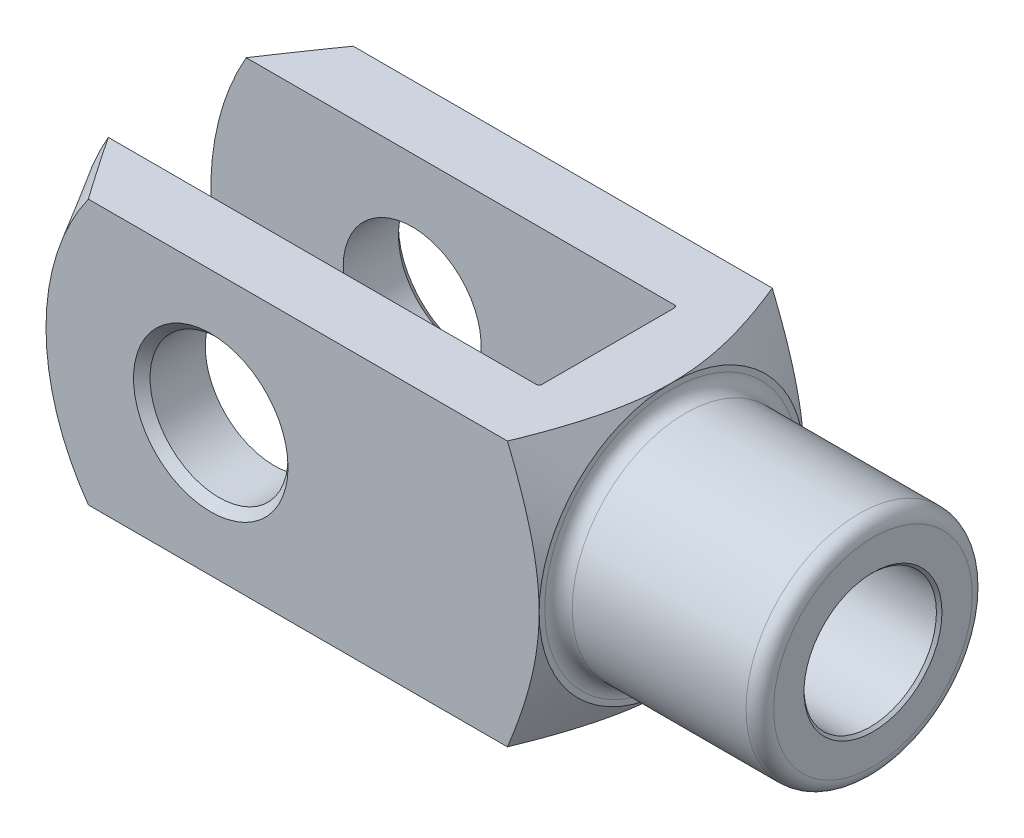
ISO-10303-21;
HEADER;
FILE_DESCRIPTION(('STEP AP214'),'2;1');
FILE_NAME('part.step','',(''),(''),'','','');
FILE_SCHEMA(('AUTOMOTIVE_DESIGN { 1 0 10303 214 1 1 1 1 }'));
ENDSEC;
DATA;
#1=APPLICATION_CONTEXT('core data for automotive mechanical design processes');
#2=APPLICATION_PROTOCOL_DEFINITION('international standard','automotive_design',2000,#1);
#3=PRODUCT_CONTEXT('',#1,'mechanical');
#4=PRODUCT('Part','Part','',(#3));
#5=PRODUCT_RELATED_PRODUCT_CATEGORY('part','',(#4));
#6=PRODUCT_DEFINITION_FORMATION('','',#4);
#7=PRODUCT_DEFINITION_CONTEXT('part definition',#1,'design');
#8=PRODUCT_DEFINITION('design','',#6,#7);
#9=PRODUCT_DEFINITION_SHAPE('','',#8);
#10=(LENGTH_UNIT() NAMED_UNIT(*) SI_UNIT(.MILLI.,.METRE.));
#11=(NAMED_UNIT(*) PLANE_ANGLE_UNIT() SI_UNIT($,.RADIAN.));
#12=(NAMED_UNIT(*) SI_UNIT($,.STERADIAN.) SOLID_ANGLE_UNIT());
#13=UNCERTAINTY_MEASURE_WITH_UNIT(LENGTH_MEASURE(1.E-05),#10,'distance_accuracy_value','');
#14=(GEOMETRIC_REPRESENTATION_CONTEXT(3) GLOBAL_UNCERTAINTY_ASSIGNED_CONTEXT((#13)) GLOBAL_UNIT_ASSIGNED_CONTEXT((#10,
#11,#12)) REPRESENTATION_CONTEXT('',''));
#15=CARTESIAN_POINT('',(0.,0.,0.));
#16=DIRECTION('',(0.,0.,1.));
#17=DIRECTION('',(1.,0.,0.));
#18=AXIS2_PLACEMENT_3D('',#15,#16,#17);
#19=CARTESIAN_POINT('',(-96.,-48.,-25.));
#20=DIRECTION('',(1.,0.,0.));
#21=DIRECTION('',(0.,0.,-1.));
#22=AXIS2_PLACEMENT_3D('',#19,#20,#21);
#23=PLANE('',#22);
#24=DIRECTION('',(0.,1.,0.));
#25=VECTOR('',#24,1.);
#26=CARTESIAN_POINT('',(-96.,-48.,-24.));
#27=LINE('',#26,#25);
#28=CARTESIAN_POINT('',(-96.,48.,-24.));
#29=VERTEX_POINT('',#28);
#30=CARTESIAN_POINT('',(-96.,0.,-24.));
#31=VERTEX_POINT('',#30);
#32=EDGE_CURVE('E144',#29,#31,#27,.F.);
#33=ORIENTED_EDGE('',*,*,#32,.T.);
#34=CARTESIAN_POINT('',(-96.,0.,0.));
#35=DIRECTION('',(1.,0.,0.));
#36=DIRECTION('',(0.,0.,-1.));
#37=AXIS2_PLACEMENT_3D('',#34,#35,#36);
#38=CIRCLE('',#37,24.);
#39=CARTESIAN_POINT('',(-96.,0.,24.));
#40=VERTEX_POINT('',#39);
#41=EDGE_CURVE('E52',#31,#40,#38,.T.);
#42=ORIENTED_EDGE('',*,*,#41,.T.);
#43=DIRECTION('',(0.,1.,0.));
#44=VECTOR('',#43,1.);
#45=CARTESIAN_POINT('',(-96.,48.,24.));
#46=LINE('',#45,#44);
#47=CARTESIAN_POINT('',(-96.,48.,24.));
#48=VERTEX_POINT('',#47);
#49=EDGE_CURVE('E141',#40,#48,#46,.T.);
#50=ORIENTED_EDGE('',*,*,#49,.T.);
#51=DIRECTION('',(0.,0.,-1.));
#52=VECTOR('',#51,1.);
#53=CARTESIAN_POINT('',(-96.,48.,-25.));
#54=LINE('',#53,#52);
#55=EDGE_CURVE('E321',#48,#29,#54,.T.);
#56=ORIENTED_EDGE('',*,*,#55,.T.);
#57=EDGE_LOOP('',(#33,#42,#50,#56));
#58=FACE_BOUND('',#57,.T.);
#59=ADVANCED_FACE('F37',(#58),#23,.F.);
#60=CARTESIAN_POINT('',(-265.,-48.,-25.));
#61=DIRECTION('',(0.,0.,-1.));
#62=DIRECTION('',(-1.,0.,0.));
#63=AXIS2_PLACEMENT_3D('',#60,#61,#62);
#64=PLANE('',#63);
#65=CARTESIAN_POINT('',(-192.,0.,-25.));
#66=DIRECTION('',(0.,0.,-1.));
#67=DIRECTION('',(-1.,0.,0.));
#68=AXIS2_PLACEMENT_3D('',#65,#66,#67);
#69=CIRCLE('',#68,25.);
#70=CARTESIAN_POINT('',(-217.,0.,-25.));
#71=VERTEX_POINT('',#70);
#72=EDGE_CURVE('E349',#71,#71,#69,.F.);
#73=ORIENTED_EDGE('',*,*,#72,.F.);
#74=EDGE_LOOP('',(#73));
#75=FACE_BOUND('',#74,.T.);
#76=DIRECTION('',(-1.,0.,0.));
#77=VECTOR('',#76,1.);
#78=CARTESIAN_POINT('',(-265.,48.,-25.));
#79=LINE('',#78,#77);
#80=CARTESIAN_POINT('',(-97.,48.,-25.));
#81=VERTEX_POINT('',#80);
#82=CARTESIAN_POINT('',(-252.138438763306,48.,-25.));
#83=VERTEX_POINT('',#82);
#84=EDGE_CURVE('E327',#81,#83,#79,.T.);
#85=ORIENTED_EDGE('',*,*,#84,.T.);
#86=CARTESIAN_POINT('',(-169.,0.,-25.));
#87=DIRECTION('',(0.,0.,1.));
#88=DIRECTION('',(1.,0.,0.));
#89=AXIS2_PLACEMENT_3D('',#86,#87,#88);
#90=CIRCLE('',#89,96.);
#91=CARTESIAN_POINT('',(-252.138438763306,-48.,-25.));
#92=VERTEX_POINT('',#91);
#93=EDGE_CURVE('E260',#83,#92,#90,.T.);
#94=ORIENTED_EDGE('',*,*,#93,.T.);
#95=DIRECTION('',(-1.,0.,0.));
#96=VECTOR('',#95,1.);
#97=CARTESIAN_POINT('',(-265.,-48.,-25.));
#98=LINE('',#97,#96);
#99=CARTESIAN_POINT('',(-97.,-48.,-25.));
#100=VERTEX_POINT('',#99);
#101=EDGE_CURVE('E316',#100,#92,#98,.T.);
#102=ORIENTED_EDGE('',*,*,#101,.F.);
#103=DIRECTION('',(0.,1.,0.));
#104=VECTOR('',#103,1.);
#105=CARTESIAN_POINT('',(-97.,48.,-25.));
#106=LINE('',#105,#104);
#107=EDGE_CURVE('E167',#100,#81,#106,.T.);
#108=ORIENTED_EDGE('',*,*,#107,.T.);
#109=EDGE_LOOP('',(#85,#94,#102,#108));
#110=FACE_BOUND('',#109,.T.);
#111=ADVANCED_FACE('F358',(#75,#110),#64,.F.);
#112=CARTESIAN_POINT('',(-265.,-48.,25.0000000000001));
#113=DIRECTION('',(0.,0.,1.));
#114=DIRECTION('',(1.,0.,0.));
#115=AXIS2_PLACEMENT_3D('',#112,#113,#114);
#116=PLANE('',#115);
#117=CARTESIAN_POINT('',(-192.,0.,25.));
#118=DIRECTION('',(0.,0.,1.));
#119=DIRECTION('',(1.,0.,0.));
#120=AXIS2_PLACEMENT_3D('',#117,#118,#119);
#121=CIRCLE('',#120,25.);
#122=CARTESIAN_POINT('',(-167.,0.,25.));
#123=VERTEX_POINT('',#122);
#124=EDGE_CURVE('E326',#123,#123,#121,.F.);
#125=ORIENTED_EDGE('',*,*,#124,.F.);
#126=EDGE_LOOP('',(#125));
#127=FACE_BOUND('',#126,.T.);
#128=CARTESIAN_POINT('',(-169.,0.,25.0000000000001));
#129=DIRECTION('',(0.,0.,1.));
#130=DIRECTION('',(1.,0.,0.));
#131=AXIS2_PLACEMENT_3D('',#128,#129,#130);
#132=CIRCLE('',#131,96.);
#133=CARTESIAN_POINT('',(-252.138438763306,48.,25.0000000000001));
#134=VERTEX_POINT('',#133);
#135=CARTESIAN_POINT('',(-252.138438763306,-48.,25.0000000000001));
#136=VERTEX_POINT('',#135);
#137=EDGE_CURVE('E146',#134,#136,#132,.T.);
#138=ORIENTED_EDGE('',*,*,#137,.F.);
#139=DIRECTION('',(1.,0.,0.));
#140=VECTOR('',#139,1.);
#141=CARTESIAN_POINT('',(-265.,48.,25.0000000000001));
#142=LINE('',#141,#140);
#143=CARTESIAN_POINT('',(-97.,48.,25.));
#144=VERTEX_POINT('',#143);
#145=EDGE_CURVE('E331',#134,#144,#142,.T.);
#146=ORIENTED_EDGE('',*,*,#145,.T.);
#147=DIRECTION('',(0.,1.,0.));
#148=VECTOR('',#147,1.);
#149=CARTESIAN_POINT('',(-97.,-48.,25.));
#150=LINE('',#149,#148);
#151=CARTESIAN_POINT('',(-97.,-48.,25.));
#152=VERTEX_POINT('',#151);
#153=EDGE_CURVE('E163',#144,#152,#150,.F.);
#154=ORIENTED_EDGE('',*,*,#153,.T.);
#155=DIRECTION('',(1.,0.,0.));
#156=VECTOR('',#155,1.);
#157=CARTESIAN_POINT('',(-265.,-48.,25.0000000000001));
#158=LINE('',#157,#156);
#159=EDGE_CURVE('E320',#136,#152,#158,.T.);
#160=ORIENTED_EDGE('',*,*,#159,.F.);
#161=EDGE_LOOP('',(#138,#146,#154,#160));
#162=FACE_BOUND('',#161,.T.);
#163=ADVANCED_FACE('F361',(#127,#162),#116,.F.);
#164=CARTESIAN_POINT('',(-265.,-48.,48.));
#165=DIRECTION('',(0.,0.,1.));
#166=DIRECTION('',(1.,0.,0.));
#167=AXIS2_PLACEMENT_3D('',#164,#165,#166);
#168=PLANE('',#167);
#169=CARTESIAN_POINT('',(-192.,0.,48.));
#170=DIRECTION('',(0.,0.,1.));
#171=DIRECTION('',(1.,0.,0.));
#172=AXIS2_PLACEMENT_3D('',#169,#170,#171);
#173=CIRCLE('',#172,28.);
#174=CARTESIAN_POINT('',(-164.,0.,48.));
#175=VERTEX_POINT('',#174);
#176=EDGE_CURVE('E214',#175,#175,#173,.F.);
#177=ORIENTED_EDGE('',*,*,#176,.T.);
#178=EDGE_LOOP('',(#177));
#179=FACE_BOUND('',#178,.T.);
#180=DIRECTION('',(1.,0.,0.));
#181=VECTOR('',#180,1.);
#182=CARTESIAN_POINT('',(-265.,48.,48.));
#183=LINE('',#182,#181);
#184=CARTESIAN_POINT('',(-236.370279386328,48.,48.));
#185=VERTEX_POINT('',#184);
#186=CARTESIAN_POINT('',(-84.4790229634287,48.,48.));
#187=VERTEX_POINT('',#186);
#188=EDGE_CURVE('E346',#185,#187,#183,.T.);
#189=ORIENTED_EDGE('',*,*,#188,.F.);
#190=CARTESIAN_POINT('',(-169.,0.,48.));
#191=DIRECTION('',(0.,0.,1.));
#192=DIRECTION('',(1.,0.,0.));
#193=AXIS2_PLACEMENT_3D('',#190,#191,#192);
#194=CIRCLE('',#193,82.7209438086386);
#195=CARTESIAN_POINT('',(-236.370279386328,-48.,48.));
#196=VERTEX_POINT('',#195);
#197=EDGE_CURVE('E60',#185,#196,#194,.T.);
#198=ORIENTED_EDGE('',*,*,#197,.T.);
#199=DIRECTION('',(1.,0.,0.));
#200=VECTOR('',#199,1.);
#201=CARTESIAN_POINT('',(-265.,-48.,48.));
#202=LINE('',#201,#200);
#203=CARTESIAN_POINT('',(-84.4790229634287,-48.,48.));
#204=VERTEX_POINT('',#203);
#205=EDGE_CURVE('E343',#196,#204,#202,.T.);
#206=ORIENTED_EDGE('',*,*,#205,.T.);
#207=CARTESIAN_POINT('',(-108.308192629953,-98.0354090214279,48.));
#208=CARTESIAN_POINT('',(-107.694862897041,-96.8525739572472,48.));
#209=CARTESIAN_POINT('',(-107.083209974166,-95.6688681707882,48.));
#210=CARTESIAN_POINT('',(-105.863625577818,-93.2995363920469,48.));
#211=CARTESIAN_POINT('',(-105.255694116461,-92.1139103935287,48.));
#212=CARTESIAN_POINT('',(-104.043892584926,-89.740504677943,48.));
#213=CARTESIAN_POINT('',(-103.440022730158,-88.5527248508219,48.));
#214=CARTESIAN_POINT('',(-102.236818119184,-86.1748731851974,48.));
#215=CARTESIAN_POINT('',(-101.637483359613,-84.9848013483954,48.));
#216=CARTESIAN_POINT('',(-99.8449063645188,-81.4066664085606,48.));
#217=CARTESIAN_POINT('',(-98.6592031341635,-79.0148119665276,48.));
#218=CARTESIAN_POINT('',(-96.8993793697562,-75.4178937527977,48.));
#219=CARTESIAN_POINT('',(-96.3158968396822,-74.2174056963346,48.));
#220=CARTESIAN_POINT('',(-95.1559400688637,-71.813049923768,48.));
#221=CARTESIAN_POINT('',(-94.579465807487,-70.609182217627,48.));
#222=CARTESIAN_POINT('',(-93.3991550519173,-68.1235233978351,48.));
#223=CARTESIAN_POINT('',(-92.7958173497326,-66.8414952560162,48.));
#224=CARTESIAN_POINT('',(-91.5992081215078,-64.2727443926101,48.));
#225=CARTESIAN_POINT('',(-91.0059366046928,-62.9860216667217,48.));
#226=CARTESIAN_POINT('',(-89.8308392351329,-60.4072661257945,48.));
#227=CARTESIAN_POINT('',(-89.2490140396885,-59.1152330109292,48.));
#228=CARTESIAN_POINT('',(-88.0985090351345,-56.5253226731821,48.));
#229=CARTESIAN_POINT('',(-87.5298292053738,-55.2274454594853,48.));
#230=CARTESIAN_POINT('',(-86.4078262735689,-52.6257418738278,48.));
#231=CARTESIAN_POINT('',(-85.8544964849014,-51.3219183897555,48.));
#232=CARTESIAN_POINT('',(-84.7652471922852,-48.7069951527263,48.));
#233=CARTESIAN_POINT('',(-84.2293278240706,-47.3958953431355,48.));
#234=CARTESIAN_POINT('',(-83.1776937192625,-44.7657404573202,48.));
#235=CARTESIAN_POINT('',(-82.6619771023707,-43.4466861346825,48.));
#236=CARTESIAN_POINT('',(-81.6539528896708,-40.7996857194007,48.));
#237=CARTESIAN_POINT('',(-81.1616447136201,-39.4717398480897,48.));
#238=CARTESIAN_POINT('',(-80.1004124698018,-36.5170564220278,48.));
#239=CARTESIAN_POINT('',(-79.5380186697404,-34.8879592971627,48.));
#240=CARTESIAN_POINT('',(-78.461578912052,-31.6137870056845,48.));
#241=CARTESIAN_POINT('',(-77.9475329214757,-29.9687118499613,48.));
#242=CARTESIAN_POINT('',(-76.9774060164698,-26.6615412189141,48.));
#243=CARTESIAN_POINT('',(-76.5213214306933,-24.9994468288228,48.));
#244=CARTESIAN_POINT('',(-75.677983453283,-21.6577740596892,48.));
#245=CARTESIAN_POINT('',(-75.2907292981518,-19.9781958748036,48.));
#246=CARTESIAN_POINT('',(-74.6048773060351,-16.6418443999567,48.));
#247=CARTESIAN_POINT('',(-74.3044117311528,-14.9854612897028,48.));
#248=CARTESIAN_POINT('',(-73.919211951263,-12.4908559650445,48.));
#249=CARTESIAN_POINT('',(-73.8017248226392,-11.657613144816,48.));
#250=CARTESIAN_POINT('',(-73.5897307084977,-9.98822265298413,48.));
#251=CARTESIAN_POINT('',(-73.4952226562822,-9.15207511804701,48.));
#252=CARTESIAN_POINT('',(-73.3302464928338,-7.47792979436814,48.));
#253=CARTESIAN_POINT('',(-73.2597635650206,-6.6399334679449,48.));
#254=CARTESIAN_POINT('',(-73.1435455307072,-4.96221844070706,48.));
#255=CARTESIAN_POINT('',(-73.0978104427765,-4.12249973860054,48.));
#256=CARTESIAN_POINT('',(-73.031622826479,-2.44208544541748,48.));
#257=CARTESIAN_POINT('',(-73.0111696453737,-1.60138988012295,48.));
#258=CARTESIAN_POINT('',(-72.9957879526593,0.0802322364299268,48.));
#259=CARTESIAN_POINT('',(-73.0008592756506,0.921158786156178,48.));
#260=CARTESIAN_POINT('',(-73.0351658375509,2.54119808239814,48.));
#261=CARTESIAN_POINT('',(-73.0626131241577,3.32034936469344,48.));
#262=CARTESIAN_POINT('',(-73.1391107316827,4.87758350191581,48.));
#263=CARTESIAN_POINT('',(-73.1881609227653,5.65566636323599,48.));
#264=CARTESIAN_POINT('',(-73.3073786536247,7.21018865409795,48.));
#265=CARTESIAN_POINT('',(-73.3775455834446,7.98662813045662,48.));
#266=CARTESIAN_POINT('',(-73.5383215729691,9.53739823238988,48.));
#267=CARTESIAN_POINT('',(-73.6289314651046,10.3117287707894,48.));
#268=CARTESIAN_POINT('',(-73.9303235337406,12.6316009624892,48.));
#269=CARTESIAN_POINT('',(-74.1706179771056,14.1733850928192,48.));
#270=CARTESIAN_POINT('',(-74.7220114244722,17.2440731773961,48.));
#271=CARTESIAN_POINT('',(-75.0331124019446,18.7729767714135,48.));
#272=CARTESIAN_POINT('',(-75.7273608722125,21.8607684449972,48.));
#273=CARTESIAN_POINT('',(-76.112333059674,23.4192435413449,48.));
#274=CARTESIAN_POINT('',(-76.938793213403,26.5210574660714,48.));
#275=CARTESIAN_POINT('',(-77.3802817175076,28.0643961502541,48.));
#276=CARTESIAN_POINT('',(-78.0784956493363,30.3683481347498,48.));
#277=CARTESIAN_POINT('',(-78.3172280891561,31.1344823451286,48.));
#278=CARTESIAN_POINT('',(-78.8057436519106,32.6632254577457,48.));
#279=CARTESIAN_POINT('',(-79.0555267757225,33.4258343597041,48.));
#280=CARTESIAN_POINT('',(-79.5652216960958,34.9476047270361,48.));
#281=CARTESIAN_POINT('',(-79.8251329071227,35.7067663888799,48.));
#282=CARTESIAN_POINT('',(-80.3542695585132,37.2218281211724,48.));
#283=CARTESIAN_POINT('',(-80.6234949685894,37.9777282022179,48.));
#284=CARTESIAN_POINT('',(-81.4885501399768,40.3637234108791,48.));
#285=CARTESIAN_POINT('',(-82.1000879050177,41.9881389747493,48.));
#286=CARTESIAN_POINT('',(-83.3563664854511,45.2241183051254,48.));
#287=CARTESIAN_POINT('',(-84.0011093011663,46.8356812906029,48.));
#288=CARTESIAN_POINT('',(-85.318437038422,50.0477869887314,48.));
#289=CARTESIAN_POINT('',(-85.9910281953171,51.6483271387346,48.));
#290=CARTESIAN_POINT('',(-87.359419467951,54.8393953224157,48.));
#291=CARTESIAN_POINT('',(-88.055219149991,56.4299235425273,48.));
#292=CARTESIAN_POINT('',(-89.4670028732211,59.6036265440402,48.));
#293=CARTESIAN_POINT('',(-90.1830038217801,61.1867937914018,48.));
#294=CARTESIAN_POINT('',(-91.6316329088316,64.3454990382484,48.));
#295=CARTESIAN_POINT('',(-92.3642611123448,65.9210370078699,48.));
#296=CARTESIAN_POINT('',(-93.8436136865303,69.0652561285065,48.));
#297=CARTESIAN_POINT('',(-94.5903364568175,70.6339380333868,48.));
#298=CARTESIAN_POINT('',(-96.0959449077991,73.7654452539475,48.));
#299=CARTESIAN_POINT('',(-96.8548305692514,75.3282705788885,48.));
#300=CARTESIAN_POINT('',(-98.3854277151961,78.4535290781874,48.));
#301=CARTESIAN_POINT('',(-99.1571712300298,80.01594655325,48.));
#302=CARTESIAN_POINT('',(-100.709821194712,83.1362193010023,48.));
#303=CARTESIAN_POINT('',(-101.490727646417,84.6940745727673,48.));
#304=CARTESIAN_POINT('',(-103.060545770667,87.8057825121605,48.));
#305=CARTESIAN_POINT('',(-103.849457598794,89.3596351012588,48.));
#306=CARTESIAN_POINT('',(-105.434292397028,92.4637620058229,48.));
#307=CARTESIAN_POINT('',(-106.230215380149,94.0140363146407,48.));
#308=CARTESIAN_POINT('',(-108.626421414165,98.6585597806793,48.));
#309=CARTESIAN_POINT('',(-110.23592310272,101.748054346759,48.));
#310=CARTESIAN_POINT('',(-113.474200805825,107.916877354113,48.));
#311=CARTESIAN_POINT('',(-115.102976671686,110.996205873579,48.));
#312=CARTESIAN_POINT('',(-118.13294338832,116.689941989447,48.));
#313=CARTESIAN_POINT('',(-119.532010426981,119.305480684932,48.));
#314=CARTESIAN_POINT('',(-122.339516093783,124.531524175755,48.));
#315=CARTESIAN_POINT('',(-123.747954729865,127.142028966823,48.));
#316=CARTESIAN_POINT('',(-126.572935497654,132.359123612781,48.));
#317=CARTESIAN_POINT('',(-127.989478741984,134.965712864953,48.));
#318=CARTESIAN_POINT('',(-130.829294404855,140.175220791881,48.));
#319=CARTESIAN_POINT('',(-132.252566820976,142.778139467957,48.));
#320=CARTESIAN_POINT('',(-135.096714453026,147.965911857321,48.));
#321=CARTESIAN_POINT('',(-136.517556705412,150.550783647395,48.));
#322=CARTESIAN_POINT('',(-139.364175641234,155.717809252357,48.));
#323=CARTESIAN_POINT('',(-140.789952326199,158.299963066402,48.));
#324=CARTESIAN_POINT('',(-143.645568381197,163.461489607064,48.));
#325=CARTESIAN_POINT('',(-145.075407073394,166.04086270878,48.));
#326=CARTESIAN_POINT('',(-147.938852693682,171.197512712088,48.));
#327=CARTESIAN_POINT('',(-149.372459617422,173.774789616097,48.));
#328=CARTESIAN_POINT('',(-150.80769290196,176.351159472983,48.));
#329=B_SPLINE_CURVE_WITH_KNOTS('',3,(#207,#208,#209,#210,#211,#212,#213,#214,#215,#216,#217,
#218,#219,#220,#221,#222,#223,#224,#225,#226,#227,#228,#229,#230,#231,#232,#233,#234,#235,#236,
#237,#238,#239,#240,#241,#242,#243,#244,#245,#246,#247,#248,#249,#250,#251,#252,#253,#254,#255,
#256,#257,#258,#259,#260,#261,#262,#263,#264,#265,#266,#267,#268,#269,#270,#271,#272,#273,#274,
#275,#276,#277,#278,#279,#280,#281,#282,#283,#284,#285,#286,#287,#288,#289,#290,#291,#292,#293,
#294,#295,#296,#297,#298,#299,#300,#301,#302,#303,#304,#305,#306,#307,#308,#309,#310,#311,#312,
#313,#314,#315,#316,#317,#318,#319,#320,#321,#322,#323,#324,#325,#326,#327,#328),.UNSPECIFIED.,
.F.,.F.,(4,2,2,2,2,2,2,2,2,2,2,2,2,2,2,2,2,2,2,2,2,2,2,2,2,2,2,2,2,2,2,2,2,2,2,2,2,2,2,2,2,2,2,
2,2,2,2,2,2,2,2,2,2,2,2,2,2,2,2,2,4),(0.,3.99718034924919,7.99437370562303,11.9917774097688,
15.9891781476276,23.9978898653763,28.0021962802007,32.0064909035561,36.2571599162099,
40.5078328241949,44.7587491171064,49.0096587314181,53.2586865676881,57.5077475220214,
61.7564120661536,66.0049712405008,71.1746492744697,76.3443237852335,81.5136706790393,
86.6829602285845,91.7309053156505,94.2550942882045,96.7791660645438,99.3016783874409,
101.824192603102,104.346641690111,106.869074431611,109.207677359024,111.546266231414,
113.884787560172,116.223404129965,120.902555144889,125.581836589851,130.396555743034,
135.211320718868,137.618658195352,140.025995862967,142.433194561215,144.840385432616,
150.047034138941,155.253996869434,160.46213183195,165.670169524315,170.882703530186,
176.095257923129,181.307223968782,186.519181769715,191.747017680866,196.974854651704,
202.202793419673,207.430741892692,217.881445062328,228.332067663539,237.230690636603,
246.129321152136,255.02920410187,263.92908385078,272.777986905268,281.626892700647,
290.474399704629,299.321896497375),.UNSPECIFIED.);
#330=CARTESIAN_POINT('',(-73.,0.,48.));
#331=VERTEX_POINT('',#330);
#332=EDGE_CURVE('E289',#331,#204,#329,.F.);
#333=ORIENTED_EDGE('',*,*,#332,.F.);
#334=EDGE_CURVE('E287',#187,#331,#329,.F.);
#335=ORIENTED_EDGE('',*,*,#334,.F.);
#336=EDGE_LOOP('',(#189,#198,#206,#333,#335));
#337=FACE_BOUND('',#336,.T.);
#338=ADVANCED_FACE('F271',(#179,#337),#168,.T.);
#339=CARTESIAN_POINT('',(-265.,-48.,48.));
#340=DIRECTION('',(0.,-1.,0.));
#341=DIRECTION('',(0.,0.,-1.));
#342=AXIS2_PLACEMENT_3D('',#339,#340,#341);
#343=PLANE('',#342);
#344=ORIENTED_EDGE('',*,*,#101,.T.);
#345=CARTESIAN_POINT('',(-312.454037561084,-48.,70.7330128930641));
#346=CARTESIAN_POINT('',(-311.128214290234,-48.,68.5553003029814));
#347=CARTESIAN_POINT('',(-309.801047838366,-48.,66.3784056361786));
#348=CARTESIAN_POINT('',(-307.143782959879,-48.,62.0264050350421));
#349=CARTESIAN_POINT('',(-305.813684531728,-48.,59.8512991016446));
#350=CARTESIAN_POINT('',(-301.818604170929,-48.,53.3288632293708));
#351=CARTESIAN_POINT('',(-299.14885783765,-48.,48.984449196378));
#352=CARTESIAN_POINT('',(-293.793929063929,-48.,40.3044324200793));
#353=CARTESIAN_POINT('',(-291.108744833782,-48.,35.9688307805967));
#354=CARTESIAN_POINT('',(-285.720179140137,-48.,27.3089572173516));
#355=CARTESIAN_POINT('',(-283.016797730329,-48.,22.9846852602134));
#356=CARTESIAN_POINT('',(-278.948035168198,-48.,16.5135257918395));
#357=CARTESIAN_POINT('',(-277.591006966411,-48.,14.3613848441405));
#358=CARTESIAN_POINT('',(-274.870785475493,-48.,10.0610034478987));
#359=CARTESIAN_POINT('',(-273.507592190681,-48.,7.91276299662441));
#360=CARTESIAN_POINT('',(-270.774325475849,-48.,3.6206406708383));
#361=CARTESIAN_POINT('',(-269.404251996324,-48.,1.47675882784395));
#362=CARTESIAN_POINT('',(-266.65641010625,-48.,-2.80606868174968));
#363=CARTESIAN_POINT('',(-265.27864169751,-48.,-4.94501434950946));
#364=CARTESIAN_POINT('',(-262.51439761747,-48.,-9.21738179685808));
#365=CARTESIAN_POINT('',(-261.127921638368,-48.,-11.3508033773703));
#366=CARTESIAN_POINT('',(-258.34517510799,-48.,-15.6112553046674));
#367=CARTESIAN_POINT('',(-256.948904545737,-48.,-17.7382856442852));
#368=CARTESIAN_POINT('',(-254.145239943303,-48.,-21.9849740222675));
#369=CARTESIAN_POINT('',(-252.737846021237,-48.,-24.1046321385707));
#370=CARTESIAN_POINT('',(-249.910316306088,-48.,-28.3354272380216));
#371=CARTESIAN_POINT('',(-248.490180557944,-48.,-30.446564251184));
#372=CARTESIAN_POINT('',(-245.63293449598,-48.,-34.6622646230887));
#373=CARTESIAN_POINT('',(-244.195800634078,-48.,-36.7668120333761));
#374=CARTESIAN_POINT('',(-241.304432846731,-48.,-40.9641147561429));
#375=CARTESIAN_POINT('',(-239.850199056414,-48.,-43.0568701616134));
#376=CARTESIAN_POINT('',(-236.922043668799,-48.,-47.2278204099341));
#377=CARTESIAN_POINT('',(-235.448126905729,-48.,-49.3060186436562));
#378=CARTESIAN_POINT('',(-232.476576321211,-48.,-53.4455106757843));
#379=CARTESIAN_POINT('',(-230.978941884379,-48.,-55.5068040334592));
#380=CARTESIAN_POINT('',(-228.710342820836,-48.,-58.5843266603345));
#381=CARTESIAN_POINT('',(-227.949984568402,-48.,-59.6083806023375));
#382=CARTESIAN_POINT('',(-226.421455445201,-48.,-61.6506440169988));
#383=CARTESIAN_POINT('',(-225.653284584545,-48.,-62.6688534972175));
#384=CARTESIAN_POINT('',(-224.108392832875,-48.,-64.698660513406));
#385=CARTESIAN_POINT('',(-223.331672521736,-48.,-65.7102584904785));
#386=CARTESIAN_POINT('',(-221.768725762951,-48.,-67.7260826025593));
#387=CARTESIAN_POINT('',(-220.982499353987,-48.,-68.730308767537));
#388=CARTESIAN_POINT('',(-219.39888927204,-48.,-70.7311876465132));
#389=CARTESIAN_POINT('',(-218.601497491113,-48.,-71.7278339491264));
#390=CARTESIAN_POINT('',(-216.994961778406,-48.,-73.711588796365));
#391=CARTESIAN_POINT('',(-216.185818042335,-48.,-74.6986974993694));
#392=CARTESIAN_POINT('',(-214.554172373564,-48.,-76.6622430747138));
#393=CARTESIAN_POINT('',(-213.731667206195,-48.,-77.6386772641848));
#394=CARTESIAN_POINT('',(-212.486808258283,-48.,-79.0938731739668));
#395=CARTESIAN_POINT('',(-212.069992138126,-48.,-79.5773772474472));
#396=CARTESIAN_POINT('',(-211.232427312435,-48.,-80.5409752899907));
#397=CARTESIAN_POINT('',(-210.811678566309,-48.,-81.0210692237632));
#398=CARTESIAN_POINT('',(-210.388847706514,-48.,-81.4993290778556));
#399=B_SPLINE_CURVE_WITH_KNOTS('',3,(#345,#346,#347,#348,#349,#350,#351,#352,#353,#354,#355,
#356,#357,#358,#359,#360,#361,#362,#363,#364,#365,#366,#367,#368,#369,#370,#371,#372,#373,#374,
#375,#376,#377,#378,#379,#380,#381,#382,#383,#384,#385,#386,#387,#388,#389,#390,#391,#392,#393,
#394,#395,#396,#397,#398),.UNSPECIFIED.,.F.,.F.,(4,2,2,2,2,2,2,2,2,2,2,2,2,2,2,2,2,2,2,2,2,2,2,
2,2,2,4),(0.,7.64866915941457,15.2973423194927,30.5948079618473,45.8940843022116,
61.1933155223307,68.8260736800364,76.4588264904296,84.0916342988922,91.7244403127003,
99.3575176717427,106.990603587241,114.623608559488,122.256586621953,129.90179238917,
137.54693778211,145.190238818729,152.833738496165,156.660127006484,160.486510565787,
164.312636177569,168.138746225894,171.967795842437,175.796781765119,179.62670888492,
181.541789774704,183.456890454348),.UNSPECIFIED.);
#400=CARTESIAN_POINT('',(-236.370279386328,-48.,-48.));
#401=VERTEX_POINT('',#400);
#402=EDGE_CURVE('E259',#92,#401,#399,.T.);
#403=ORIENTED_EDGE('',*,*,#402,.T.);
#404=DIRECTION('',(1.,0.,0.));
#405=VECTOR('',#404,1.);
#406=CARTESIAN_POINT('',(-265.,-48.,-48.));
#407=LINE('',#406,#405);
#408=CARTESIAN_POINT('',(-84.4790229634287,-48.,-48.));
#409=VERTEX_POINT('',#408);
#410=EDGE_CURVE('E340',#401,#409,#407,.T.);
#411=ORIENTED_EDGE('',*,*,#410,.T.);
#412=CARTESIAN_POINT('',(-108.308192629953,-48.,-98.0354090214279));
#413=CARTESIAN_POINT('',(-107.694862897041,-48.,-96.8525739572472));
#414=CARTESIAN_POINT('',(-107.083209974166,-48.,-95.6688681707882));
#415=CARTESIAN_POINT('',(-105.863625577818,-48.,-93.2995363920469));
#416=CARTESIAN_POINT('',(-105.255694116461,-48.,-92.1139103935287));
#417=CARTESIAN_POINT('',(-104.043892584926,-48.,-89.740504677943));
#418=CARTESIAN_POINT('',(-103.440022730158,-48.,-88.5527248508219));
#419=CARTESIAN_POINT('',(-102.236818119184,-48.,-86.1748731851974));
#420=CARTESIAN_POINT('',(-101.637483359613,-48.,-84.9848013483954));
#421=CARTESIAN_POINT('',(-99.8449063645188,-48.,-81.4066664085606));
#422=CARTESIAN_POINT('',(-98.6592031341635,-48.,-79.0148119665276));
#423=CARTESIAN_POINT('',(-96.8993793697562,-48.,-75.4178937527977));
#424=CARTESIAN_POINT('',(-96.3158968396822,-48.,-74.2174056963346));
#425=CARTESIAN_POINT('',(-95.1559400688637,-48.,-71.813049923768));
#426=CARTESIAN_POINT('',(-94.579465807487,-48.,-70.609182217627));
#427=CARTESIAN_POINT('',(-93.3991550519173,-48.,-68.1235233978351));
#428=CARTESIAN_POINT('',(-92.7958173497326,-48.,-66.8414952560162));
#429=CARTESIAN_POINT('',(-91.5992081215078,-48.,-64.2727443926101));
#430=CARTESIAN_POINT('',(-91.0059366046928,-48.,-62.9860216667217));
#431=CARTESIAN_POINT('',(-89.8308392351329,-48.,-60.4072661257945));
#432=CARTESIAN_POINT('',(-89.2490140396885,-48.,-59.1152330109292));
#433=CARTESIAN_POINT('',(-88.0985090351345,-48.,-56.5253226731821));
#434=CARTESIAN_POINT('',(-87.5298292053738,-48.,-55.2274454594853));
#435=CARTESIAN_POINT('',(-86.4078262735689,-48.,-52.6257418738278));
#436=CARTESIAN_POINT('',(-85.8544964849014,-48.,-51.3219183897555));
#437=CARTESIAN_POINT('',(-84.7652471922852,-48.,-48.7069951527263));
#438=CARTESIAN_POINT('',(-84.2293278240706,-48.,-47.3958953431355));
#439=CARTESIAN_POINT('',(-83.1776937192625,-48.,-44.7657404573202));
#440=CARTESIAN_POINT('',(-82.6619771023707,-48.,-43.4466861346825));
#441=CARTESIAN_POINT('',(-81.6539528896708,-48.,-40.7996857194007));
#442=CARTESIAN_POINT('',(-81.1616447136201,-48.,-39.4717398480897));
#443=CARTESIAN_POINT('',(-80.1004124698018,-48.,-36.5170564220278));
#444=CARTESIAN_POINT('',(-79.5380186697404,-48.,-34.8879592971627));
#445=CARTESIAN_POINT('',(-78.461578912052,-48.,-31.6137870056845));
#446=CARTESIAN_POINT('',(-77.9475329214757,-48.,-29.9687118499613));
#447=CARTESIAN_POINT('',(-76.9774060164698,-48.,-26.6615412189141));
#448=CARTESIAN_POINT('',(-76.5213214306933,-48.,-24.9994468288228));
#449=CARTESIAN_POINT('',(-75.677983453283,-48.,-21.6577740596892));
#450=CARTESIAN_POINT('',(-75.2907292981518,-48.,-19.9781958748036));
#451=CARTESIAN_POINT('',(-74.6048773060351,-48.,-16.6418443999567));
#452=CARTESIAN_POINT('',(-74.3044117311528,-48.,-14.9854612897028));
#453=CARTESIAN_POINT('',(-73.919211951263,-48.,-12.4908559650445));
#454=CARTESIAN_POINT('',(-73.8017248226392,-48.,-11.657613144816));
#455=CARTESIAN_POINT('',(-73.5897307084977,-48.,-9.98822265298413));
#456=CARTESIAN_POINT('',(-73.4952226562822,-48.,-9.15207511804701));
#457=CARTESIAN_POINT('',(-73.3302464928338,-48.,-7.47792979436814));
#458=CARTESIAN_POINT('',(-73.2597635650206,-48.,-6.6399334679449));
#459=CARTESIAN_POINT('',(-73.1435455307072,-48.,-4.96221844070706));
#460=CARTESIAN_POINT('',(-73.0978104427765,-48.,-4.12249973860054));
#461=CARTESIAN_POINT('',(-73.031622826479,-48.,-2.44208544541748));
#462=CARTESIAN_POINT('',(-73.0111696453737,-48.,-1.60138988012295));
#463=CARTESIAN_POINT('',(-72.9957879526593,-48.,0.0802322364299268));
#464=CARTESIAN_POINT('',(-73.0008592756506,-48.,0.921158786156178));
#465=CARTESIAN_POINT('',(-73.0351658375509,-48.,2.54119808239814));
#466=CARTESIAN_POINT('',(-73.0626131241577,-48.,3.32034936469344));
#467=CARTESIAN_POINT('',(-73.1391107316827,-48.,4.87758350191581));
#468=CARTESIAN_POINT('',(-73.1881609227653,-48.,5.65566636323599));
#469=CARTESIAN_POINT('',(-73.3073786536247,-48.,7.21018865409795));
#470=CARTESIAN_POINT('',(-73.3775455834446,-48.,7.98662813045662));
#471=CARTESIAN_POINT('',(-73.5383215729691,-48.,9.53739823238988));
#472=CARTESIAN_POINT('',(-73.6289314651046,-48.,10.3117287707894));
#473=CARTESIAN_POINT('',(-73.9303235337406,-48.,12.6316009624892));
#474=CARTESIAN_POINT('',(-74.1706179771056,-48.,14.1733850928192));
#475=CARTESIAN_POINT('',(-74.7220114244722,-48.,17.2440731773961));
#476=CARTESIAN_POINT('',(-75.0331124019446,-48.,18.7729767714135));
#477=CARTESIAN_POINT('',(-75.7273608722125,-48.,21.8607684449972));
#478=CARTESIAN_POINT('',(-76.112333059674,-48.,23.4192435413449));
#479=CARTESIAN_POINT('',(-76.938793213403,-48.,26.5210574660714));
#480=CARTESIAN_POINT('',(-77.3802817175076,-48.,28.0643961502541));
#481=CARTESIAN_POINT('',(-78.0784956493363,-48.,30.3683481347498));
#482=CARTESIAN_POINT('',(-78.3172280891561,-48.,31.1344823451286));
#483=CARTESIAN_POINT('',(-78.8057436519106,-48.,32.6632254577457));
#484=CARTESIAN_POINT('',(-79.0555267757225,-48.,33.4258343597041));
#485=CARTESIAN_POINT('',(-79.5652216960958,-48.,34.9476047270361));
#486=CARTESIAN_POINT('',(-79.8251329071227,-48.,35.7067663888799));
#487=CARTESIAN_POINT('',(-80.3542695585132,-48.,37.2218281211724));
#488=CARTESIAN_POINT('',(-80.6234949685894,-48.,37.9777282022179));
#489=CARTESIAN_POINT('',(-81.4885501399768,-48.,40.3637234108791));
#490=CARTESIAN_POINT('',(-82.1000879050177,-48.,41.9881389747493));
#491=CARTESIAN_POINT('',(-83.3563664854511,-48.,45.2241183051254));
#492=CARTESIAN_POINT('',(-84.0011093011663,-48.,46.8356812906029));
#493=CARTESIAN_POINT('',(-85.318437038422,-48.,50.0477869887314));
#494=CARTESIAN_POINT('',(-85.9910281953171,-48.,51.6483271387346));
#495=CARTESIAN_POINT('',(-87.359419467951,-48.,54.8393953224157));
#496=CARTESIAN_POINT('',(-88.055219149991,-48.,56.4299235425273));
#497=CARTESIAN_POINT('',(-89.4670028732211,-48.,59.6036265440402));
#498=CARTESIAN_POINT('',(-90.1830038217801,-48.,61.1867937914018));
#499=CARTESIAN_POINT('',(-91.6316329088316,-48.,64.3454990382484));
#500=CARTESIAN_POINT('',(-92.3642611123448,-48.,65.9210370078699));
#501=CARTESIAN_POINT('',(-93.8436136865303,-48.,69.0652561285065));
#502=CARTESIAN_POINT('',(-94.5903364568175,-48.,70.6339380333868));
#503=CARTESIAN_POINT('',(-96.0959449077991,-48.,73.7654452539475));
#504=CARTESIAN_POINT('',(-96.8548305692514,-48.,75.3282705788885));
#505=CARTESIAN_POINT('',(-98.3854277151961,-48.,78.4535290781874));
#506=CARTESIAN_POINT('',(-99.1571712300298,-48.,80.01594655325));
#507=CARTESIAN_POINT('',(-100.709821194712,-48.,83.1362193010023));
#508=CARTESIAN_POINT('',(-101.490727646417,-48.,84.6940745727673));
#509=CARTESIAN_POINT('',(-103.060545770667,-48.,87.8057825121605));
#510=CARTESIAN_POINT('',(-103.849457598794,-48.,89.3596351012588));
#511=CARTESIAN_POINT('',(-105.434292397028,-48.,92.4637620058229));
#512=CARTESIAN_POINT('',(-106.230215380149,-48.,94.0140363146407));
#513=CARTESIAN_POINT('',(-108.626421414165,-48.,98.6585597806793));
#514=CARTESIAN_POINT('',(-110.23592310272,-48.,101.748054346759));
#515=CARTESIAN_POINT('',(-113.474200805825,-48.,107.916877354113));
#516=CARTESIAN_POINT('',(-115.102976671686,-48.,110.996205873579));
#517=CARTESIAN_POINT('',(-118.13294338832,-48.,116.689941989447));
#518=CARTESIAN_POINT('',(-119.532010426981,-48.,119.305480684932));
#519=CARTESIAN_POINT('',(-122.339516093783,-48.,124.531524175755));
#520=CARTESIAN_POINT('',(-123.747954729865,-48.,127.142028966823));
#521=CARTESIAN_POINT('',(-126.572935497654,-48.,132.359123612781));
#522=CARTESIAN_POINT('',(-127.989478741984,-48.,134.965712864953));
#523=CARTESIAN_POINT('',(-130.829294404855,-48.,140.175220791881));
#524=CARTESIAN_POINT('',(-132.252566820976,-48.,142.778139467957));
#525=CARTESIAN_POINT('',(-135.096714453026,-48.,147.965911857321));
#526=CARTESIAN_POINT('',(-136.517556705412,-48.,150.550783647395));
#527=CARTESIAN_POINT('',(-139.364175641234,-48.,155.717809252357));
#528=CARTESIAN_POINT('',(-140.789952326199,-48.,158.299963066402));
#529=CARTESIAN_POINT('',(-143.645568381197,-48.,163.461489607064));
#530=CARTESIAN_POINT('',(-145.075407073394,-48.,166.04086270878));
#531=CARTESIAN_POINT('',(-147.938852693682,-48.,171.197512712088));
#532=CARTESIAN_POINT('',(-149.372459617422,-48.,173.774789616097));
#533=CARTESIAN_POINT('',(-150.80769290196,-48.,176.351159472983));
#534=B_SPLINE_CURVE_WITH_KNOTS('',3,(#412,#413,#414,#415,#416,#417,#418,#419,#420,#421,#422,
#423,#424,#425,#426,#427,#428,#429,#430,#431,#432,#433,#434,#435,#436,#437,#438,#439,#440,#441,
#442,#443,#444,#445,#446,#447,#448,#449,#450,#451,#452,#453,#454,#455,#456,#457,#458,#459,#460,
#461,#462,#463,#464,#465,#466,#467,#468,#469,#470,#471,#472,#473,#474,#475,#476,#477,#478,#479,
#480,#481,#482,#483,#484,#485,#486,#487,#488,#489,#490,#491,#492,#493,#494,#495,#496,#497,#498,
#499,#500,#501,#502,#503,#504,#505,#506,#507,#508,#509,#510,#511,#512,#513,#514,#515,#516,#517,
#518,#519,#520,#521,#522,#523,#524,#525,#526,#527,#528,#529,#530,#531,#532,#533),.UNSPECIFIED.,
.F.,.F.,(4,2,2,2,2,2,2,2,2,2,2,2,2,2,2,2,2,2,2,2,2,2,2,2,2,2,2,2,2,2,2,2,2,2,2,2,2,2,2,2,2,2,2,
2,2,2,2,2,2,2,2,2,2,2,2,2,2,2,2,2,4),(0.,3.99718034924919,7.99437370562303,11.9917774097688,
15.9891781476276,23.9978898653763,28.0021962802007,32.0064909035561,36.2571599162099,
40.5078328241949,44.7587491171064,49.0096587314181,53.2586865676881,57.5077475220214,
61.7564120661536,66.0049712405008,71.1746492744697,76.3443237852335,81.5136706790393,
86.6829602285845,91.7309053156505,94.2550942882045,96.7791660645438,99.3016783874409,
101.824192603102,104.346641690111,106.869074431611,109.207677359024,111.546266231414,
113.884787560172,116.223404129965,120.902555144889,125.581836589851,130.396555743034,
135.211320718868,137.618658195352,140.025995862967,142.433194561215,144.840385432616,
150.047034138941,155.253996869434,160.46213183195,165.670169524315,170.882703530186,
176.095257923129,181.307223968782,186.519181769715,191.747017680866,196.974854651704,
202.202793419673,207.430741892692,217.881445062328,228.332067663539,237.230690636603,
246.129321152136,255.02920410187,263.92908385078,272.777986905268,281.626892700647,
290.474399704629,299.321896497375),.UNSPECIFIED.);
#535=CARTESIAN_POINT('',(-73.,-48.,0.));
#536=VERTEX_POINT('',#535);
#537=EDGE_CURVE('E288',#536,#409,#534,.F.);
#538=ORIENTED_EDGE('',*,*,#537,.F.);
#539=EDGE_CURVE('E279',#204,#536,#534,.F.);
#540=ORIENTED_EDGE('',*,*,#539,.F.);
#541=ORIENTED_EDGE('',*,*,#205,.F.);
#542=CARTESIAN_POINT('',(-210.388847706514,-48.,81.4993290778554));
#543=CARTESIAN_POINT('',(-210.811678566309,-48.,81.021069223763));
#544=CARTESIAN_POINT('',(-211.232427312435,-48.,80.5409752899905));
#545=CARTESIAN_POINT('',(-212.069992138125,-48.,79.577377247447));
#546=CARTESIAN_POINT('',(-212.486808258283,-48.,79.0938731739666));
#547=CARTESIAN_POINT('',(-213.731667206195,-48.,77.6386772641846));
#548=CARTESIAN_POINT('',(-214.554172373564,-48.,76.6622430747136));
#549=CARTESIAN_POINT('',(-216.185818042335,-48.,74.6986974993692));
#550=CARTESIAN_POINT('',(-216.994961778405,-48.,73.7115887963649));
#551=CARTESIAN_POINT('',(-218.601497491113,-48.,71.7278339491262));
#552=CARTESIAN_POINT('',(-219.39888927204,-48.,70.7311876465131));
#553=CARTESIAN_POINT('',(-220.982499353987,-48.,68.7303087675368));
#554=CARTESIAN_POINT('',(-221.768725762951,-48.,67.7260826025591));
#555=CARTESIAN_POINT('',(-223.331672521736,-48.,65.7102584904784));
#556=CARTESIAN_POINT('',(-224.108392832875,-48.,64.6986605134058));
#557=CARTESIAN_POINT('',(-225.653284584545,-48.,62.6688534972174));
#558=CARTESIAN_POINT('',(-226.421455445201,-48.,61.6506440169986));
#559=CARTESIAN_POINT('',(-227.949984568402,-48.,59.6083806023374));
#560=CARTESIAN_POINT('',(-228.710342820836,-48.,58.5843266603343));
#561=CARTESIAN_POINT('',(-230.978941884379,-48.,55.5068040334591));
#562=CARTESIAN_POINT('',(-232.476576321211,-48.,53.4455106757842));
#563=CARTESIAN_POINT('',(-235.448126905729,-48.,49.3060186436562));
#564=CARTESIAN_POINT('',(-236.922043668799,-48.,47.227820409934));
#565=CARTESIAN_POINT('',(-239.850199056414,-48.,43.0568701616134));
#566=CARTESIAN_POINT('',(-241.304432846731,-48.,40.9641147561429));
#567=CARTESIAN_POINT('',(-244.195800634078,-48.,36.7668120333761));
#568=CARTESIAN_POINT('',(-245.63293449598,-48.,34.6622646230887));
#569=CARTESIAN_POINT('',(-248.490180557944,-48.,30.446564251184));
#570=CARTESIAN_POINT('',(-249.910316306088,-48.,28.3354272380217));
#571=CARTESIAN_POINT('',(-252.737846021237,-48.,24.1046321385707));
#572=CARTESIAN_POINT('',(-254.145239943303,-48.,21.9849740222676));
#573=CARTESIAN_POINT('',(-256.948904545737,-48.,17.7382856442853));
#574=CARTESIAN_POINT('',(-258.34517510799,-48.,15.6112553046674));
#575=CARTESIAN_POINT('',(-261.127921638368,-48.,11.3508033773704));
#576=CARTESIAN_POINT('',(-262.51439761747,-48.,9.21738179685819));
#577=CARTESIAN_POINT('',(-265.27864169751,-48.,4.94501434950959));
#578=CARTESIAN_POINT('',(-266.65641010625,-48.,2.80606868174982));
#579=CARTESIAN_POINT('',(-269.404251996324,-48.,-1.4767588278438));
#580=CARTESIAN_POINT('',(-270.774325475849,-48.,-3.62064067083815));
#581=CARTESIAN_POINT('',(-273.507592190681,-48.,-7.91276299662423));
#582=CARTESIAN_POINT('',(-274.870785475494,-48.,-10.0610034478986));
#583=CARTESIAN_POINT('',(-277.591006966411,-48.,-14.3613848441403));
#584=CARTESIAN_POINT('',(-278.948035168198,-48.,-16.5135257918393));
#585=CARTESIAN_POINT('',(-283.016797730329,-48.,-22.9846852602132));
#586=CARTESIAN_POINT('',(-285.720179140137,-48.,-27.3089572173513));
#587=CARTESIAN_POINT('',(-291.108744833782,-48.,-35.9688307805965));
#588=CARTESIAN_POINT('',(-293.793929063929,-48.,-40.304432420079));
#589=CARTESIAN_POINT('',(-299.14885783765,-48.,-48.9844491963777));
#590=CARTESIAN_POINT('',(-301.81860417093,-48.,-53.3288632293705));
#591=CARTESIAN_POINT('',(-305.813684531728,-48.,-59.8512991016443));
#592=CARTESIAN_POINT('',(-307.14378295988,-48.,-62.0264050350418));
#593=CARTESIAN_POINT('',(-309.801047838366,-48.,-66.3784056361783));
#594=CARTESIAN_POINT('',(-311.128214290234,-48.,-68.5553003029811));
#595=CARTESIAN_POINT('',(-312.454037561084,-48.,-70.7330128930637));
#596=B_SPLINE_CURVE_WITH_KNOTS('',3,(#542,#543,#544,#545,#546,#547,#548,#549,#550,#551,#552,
#553,#554,#555,#556,#557,#558,#559,#560,#561,#562,#563,#564,#565,#566,#567,#568,#569,#570,#571,
#572,#573,#574,#575,#576,#577,#578,#579,#580,#581,#582,#583,#584,#585,#586,#587,#588,#589,#590,
#591,#592,#593,#594,#595),.UNSPECIFIED.,.F.,.F.,(4,2,2,2,2,2,2,2,2,2,2,2,2,2,2,2,2,2,2,2,2,2,2,
2,2,2,4),(0.,1.91510067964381,3.83018156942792,7.66010868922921,11.4890946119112,
15.3181442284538,19.1442542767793,22.9703798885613,26.7967634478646,30.6231519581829,
38.2666516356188,45.9099526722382,53.5550980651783,61.200303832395,68.8332818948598,
76.4662868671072,84.0993727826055,91.7324501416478,99.3652561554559,106.998063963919,
114.630816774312,122.263574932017,137.562806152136,152.862082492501,168.159548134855,
175.808221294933,183.456890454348),.UNSPECIFIED.);
#597=EDGE_CURVE('E251',#196,#136,#596,.T.);
#598=ORIENTED_EDGE('',*,*,#597,.T.);
#599=ORIENTED_EDGE('',*,*,#159,.T.);
#600=CARTESIAN_POINT('',(-97.,-48.,24.));
#601=DIRECTION('',(0.,-1.,0.));
#602=DIRECTION('',(0.,0.,-1.));
#603=AXIS2_PLACEMENT_3D('',#600,#601,#602);
#604=CIRCLE('',#603,1.);
#605=CARTESIAN_POINT('',(-96.,-48.,24.));
#606=VERTEX_POINT('',#605);
#607=EDGE_CURVE('E177',#152,#606,#604,.F.);
#608=ORIENTED_EDGE('',*,*,#607,.T.);
#609=DIRECTION('',(0.,0.,-1.));
#610=VECTOR('',#609,1.);
#611=CARTESIAN_POINT('',(-96.,-48.,-25.));
#612=LINE('',#611,#610);
#613=CARTESIAN_POINT('',(-96.,-48.,-24.));
#614=VERTEX_POINT('',#613);
#615=EDGE_CURVE('E161',#606,#614,#612,.T.);
#616=ORIENTED_EDGE('',*,*,#615,.T.);
#617=CARTESIAN_POINT('',(-97.,-48.,-24.));
#618=DIRECTION('',(0.,-1.,0.));
#619=DIRECTION('',(0.,0.,-1.));
#620=AXIS2_PLACEMENT_3D('',#617,#618,#619);
#621=CIRCLE('',#620,1.);
#622=EDGE_CURVE('E183',#614,#100,#621,.F.);
#623=ORIENTED_EDGE('',*,*,#622,.T.);
#624=EDGE_LOOP('',(#344,#403,#411,#538,#540,#541,#598,#599,#608,#616,#623));
#625=FACE_BOUND('',#624,.T.);
#626=ADVANCED_FACE('F266',(#625),#343,.T.);
#627=CARTESIAN_POINT('',(-265.,-48.,-48.));
#628=DIRECTION('',(0.,0.,-1.));
#629=DIRECTION('',(-1.,0.,0.));
#630=AXIS2_PLACEMENT_3D('',#627,#628,#629);
#631=PLANE('',#630);
#632=CARTESIAN_POINT('',(-192.,0.,-48.));
#633=DIRECTION('',(0.,0.,-1.));
#634=DIRECTION('',(-1.,0.,0.));
#635=AXIS2_PLACEMENT_3D('',#632,#633,#634);
#636=CIRCLE('',#635,28.);
#637=CARTESIAN_POINT('',(-220.,0.,-48.));
#638=VERTEX_POINT('',#637);
#639=EDGE_CURVE('E202',#638,#638,#636,.F.);
#640=ORIENTED_EDGE('',*,*,#639,.T.);
#641=EDGE_LOOP('',(#640));
#642=FACE_BOUND('',#641,.T.);
#643=ORIENTED_EDGE('',*,*,#410,.F.);
#644=CARTESIAN_POINT('',(-169.,0.,-48.));
#645=DIRECTION('',(0.,0.,1.));
#646=DIRECTION('',(1.,0.,0.));
#647=AXIS2_PLACEMENT_3D('',#644,#645,#646);
#648=CIRCLE('',#647,82.7209438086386);
#649=CARTESIAN_POINT('',(-236.370279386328,48.,-48.));
#650=VERTEX_POINT('',#649);
#651=EDGE_CURVE('E442',#650,#401,#648,.T.);
#652=ORIENTED_EDGE('',*,*,#651,.F.);
#653=DIRECTION('',(1.,0.,0.));
#654=VECTOR('',#653,1.);
#655=CARTESIAN_POINT('',(-265.,48.,-48.));
#656=LINE('',#655,#654);
#657=CARTESIAN_POINT('',(-84.4790229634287,48.,-48.));
#658=VERTEX_POINT('',#657);
#659=EDGE_CURVE('E336',#650,#658,#656,.T.);
#660=ORIENTED_EDGE('',*,*,#659,.T.);
#661=CARTESIAN_POINT('',(-108.308192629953,-98.0354090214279,-48.));
#662=CARTESIAN_POINT('',(-107.694862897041,-96.8525739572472,-48.));
#663=CARTESIAN_POINT('',(-107.083209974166,-95.6688681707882,-48.));
#664=CARTESIAN_POINT('',(-105.863625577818,-93.2995363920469,-48.));
#665=CARTESIAN_POINT('',(-105.255694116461,-92.1139103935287,-48.));
#666=CARTESIAN_POINT('',(-104.043892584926,-89.740504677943,-48.));
#667=CARTESIAN_POINT('',(-103.440022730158,-88.5527248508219,-48.));
#668=CARTESIAN_POINT('',(-102.236818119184,-86.1748731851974,-48.));
#669=CARTESIAN_POINT('',(-101.637483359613,-84.9848013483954,-48.));
#670=CARTESIAN_POINT('',(-99.8449063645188,-81.4066664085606,-48.));
#671=CARTESIAN_POINT('',(-98.6592031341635,-79.0148119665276,-48.));
#672=CARTESIAN_POINT('',(-96.8993793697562,-75.4178937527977,-48.));
#673=CARTESIAN_POINT('',(-96.3158968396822,-74.2174056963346,-48.));
#674=CARTESIAN_POINT('',(-95.1559400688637,-71.813049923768,-48.));
#675=CARTESIAN_POINT('',(-94.579465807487,-70.609182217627,-48.));
#676=CARTESIAN_POINT('',(-93.3991550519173,-68.1235233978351,-48.));
#677=CARTESIAN_POINT('',(-92.7958173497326,-66.8414952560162,-48.));
#678=CARTESIAN_POINT('',(-91.5992081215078,-64.2727443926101,-48.));
#679=CARTESIAN_POINT('',(-91.0059366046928,-62.9860216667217,-48.));
#680=CARTESIAN_POINT('',(-89.8308392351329,-60.4072661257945,-48.));
#681=CARTESIAN_POINT('',(-89.2490140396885,-59.1152330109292,-48.));
#682=CARTESIAN_POINT('',(-88.0985090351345,-56.5253226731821,-48.));
#683=CARTESIAN_POINT('',(-87.5298292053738,-55.2274454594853,-48.));
#684=CARTESIAN_POINT('',(-86.4078262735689,-52.6257418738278,-48.));
#685=CARTESIAN_POINT('',(-85.8544964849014,-51.3219183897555,-48.));
#686=CARTESIAN_POINT('',(-84.7652471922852,-48.7069951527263,-48.));
#687=CARTESIAN_POINT('',(-84.2293278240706,-47.3958953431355,-48.));
#688=CARTESIAN_POINT('',(-83.1776937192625,-44.7657404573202,-48.));
#689=CARTESIAN_POINT('',(-82.6619771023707,-43.4466861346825,-48.));
#690=CARTESIAN_POINT('',(-81.6539528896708,-40.7996857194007,-48.));
#691=CARTESIAN_POINT('',(-81.1616447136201,-39.4717398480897,-48.));
#692=CARTESIAN_POINT('',(-80.1004124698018,-36.5170564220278,-48.));
#693=CARTESIAN_POINT('',(-79.5380186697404,-34.8879592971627,-48.));
#694=CARTESIAN_POINT('',(-78.461578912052,-31.6137870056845,-48.));
#695=CARTESIAN_POINT('',(-77.9475329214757,-29.9687118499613,-48.));
#696=CARTESIAN_POINT('',(-76.9774060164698,-26.6615412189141,-48.));
#697=CARTESIAN_POINT('',(-76.5213214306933,-24.9994468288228,-48.));
#698=CARTESIAN_POINT('',(-75.677983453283,-21.6577740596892,-48.));
#699=CARTESIAN_POINT('',(-75.2907292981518,-19.9781958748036,-48.));
#700=CARTESIAN_POINT('',(-74.6048773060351,-16.6418443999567,-48.));
#701=CARTESIAN_POINT('',(-74.3044117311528,-14.9854612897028,-48.));
#702=CARTESIAN_POINT('',(-73.919211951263,-12.4908559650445,-48.));
#703=CARTESIAN_POINT('',(-73.8017248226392,-11.657613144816,-48.));
#704=CARTESIAN_POINT('',(-73.5897307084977,-9.98822265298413,-48.));
#705=CARTESIAN_POINT('',(-73.4952226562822,-9.15207511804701,-48.));
#706=CARTESIAN_POINT('',(-73.3302464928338,-7.47792979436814,-48.));
#707=CARTESIAN_POINT('',(-73.2597635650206,-6.6399334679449,-48.));
#708=CARTESIAN_POINT('',(-73.1435455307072,-4.96221844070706,-48.));
#709=CARTESIAN_POINT('',(-73.0978104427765,-4.12249973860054,-48.));
#710=CARTESIAN_POINT('',(-73.031622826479,-2.44208544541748,-48.));
#711=CARTESIAN_POINT('',(-73.0111696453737,-1.60138988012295,-48.));
#712=CARTESIAN_POINT('',(-72.9957879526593,0.0802322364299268,-48.));
#713=CARTESIAN_POINT('',(-73.0008592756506,0.921158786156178,-48.));
#714=CARTESIAN_POINT('',(-73.0351658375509,2.54119808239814,-48.));
#715=CARTESIAN_POINT('',(-73.0626131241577,3.32034936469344,-48.));
#716=CARTESIAN_POINT('',(-73.1391107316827,4.87758350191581,-48.));
#717=CARTESIAN_POINT('',(-73.1881609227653,5.65566636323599,-48.));
#718=CARTESIAN_POINT('',(-73.3073786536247,7.21018865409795,-48.));
#719=CARTESIAN_POINT('',(-73.3775455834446,7.98662813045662,-48.));
#720=CARTESIAN_POINT('',(-73.5383215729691,9.53739823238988,-48.));
#721=CARTESIAN_POINT('',(-73.6289314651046,10.3117287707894,-48.));
#722=CARTESIAN_POINT('',(-73.9303235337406,12.6316009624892,-48.));
#723=CARTESIAN_POINT('',(-74.1706179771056,14.1733850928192,-48.));
#724=CARTESIAN_POINT('',(-74.7220114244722,17.2440731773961,-48.));
#725=CARTESIAN_POINT('',(-75.0331124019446,18.7729767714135,-48.));
#726=CARTESIAN_POINT('',(-75.7273608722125,21.8607684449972,-48.));
#727=CARTESIAN_POINT('',(-76.112333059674,23.4192435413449,-48.));
#728=CARTESIAN_POINT('',(-76.938793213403,26.5210574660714,-48.));
#729=CARTESIAN_POINT('',(-77.3802817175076,28.0643961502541,-48.));
#730=CARTESIAN_POINT('',(-78.0784956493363,30.3683481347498,-48.));
#731=CARTESIAN_POINT('',(-78.3172280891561,31.1344823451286,-48.));
#732=CARTESIAN_POINT('',(-78.8057436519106,32.6632254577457,-48.));
#733=CARTESIAN_POINT('',(-79.0555267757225,33.4258343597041,-48.));
#734=CARTESIAN_POINT('',(-79.5652216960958,34.9476047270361,-48.));
#735=CARTESIAN_POINT('',(-79.8251329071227,35.7067663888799,-48.));
#736=CARTESIAN_POINT('',(-80.3542695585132,37.2218281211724,-48.));
#737=CARTESIAN_POINT('',(-80.6234949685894,37.9777282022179,-48.));
#738=CARTESIAN_POINT('',(-81.4885501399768,40.3637234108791,-48.));
#739=CARTESIAN_POINT('',(-82.1000879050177,41.9881389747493,-48.));
#740=CARTESIAN_POINT('',(-83.3563664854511,45.2241183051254,-48.));
#741=CARTESIAN_POINT('',(-84.0011093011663,46.8356812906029,-48.));
#742=CARTESIAN_POINT('',(-85.318437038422,50.0477869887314,-48.));
#743=CARTESIAN_POINT('',(-85.9910281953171,51.6483271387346,-48.));
#744=CARTESIAN_POINT('',(-87.359419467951,54.8393953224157,-48.));
#745=CARTESIAN_POINT('',(-88.055219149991,56.4299235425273,-48.));
#746=CARTESIAN_POINT('',(-89.4670028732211,59.6036265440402,-48.));
#747=CARTESIAN_POINT('',(-90.1830038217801,61.1867937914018,-48.));
#748=CARTESIAN_POINT('',(-91.6316329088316,64.3454990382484,-48.));
#749=CARTESIAN_POINT('',(-92.3642611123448,65.9210370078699,-48.));
#750=CARTESIAN_POINT('',(-93.8436136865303,69.0652561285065,-48.));
#751=CARTESIAN_POINT('',(-94.5903364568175,70.6339380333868,-48.));
#752=CARTESIAN_POINT('',(-96.0959449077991,73.7654452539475,-48.));
#753=CARTESIAN_POINT('',(-96.8548305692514,75.3282705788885,-48.));
#754=CARTESIAN_POINT('',(-98.3854277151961,78.4535290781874,-48.));
#755=CARTESIAN_POINT('',(-99.1571712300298,80.01594655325,-48.));
#756=CARTESIAN_POINT('',(-100.709821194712,83.1362193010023,-48.));
#757=CARTESIAN_POINT('',(-101.490727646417,84.6940745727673,-48.));
#758=CARTESIAN_POINT('',(-103.060545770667,87.8057825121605,-48.));
#759=CARTESIAN_POINT('',(-103.849457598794,89.3596351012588,-48.));
#760=CARTESIAN_POINT('',(-105.434292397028,92.4637620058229,-48.));
#761=CARTESIAN_POINT('',(-106.230215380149,94.0140363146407,-48.));
#762=CARTESIAN_POINT('',(-108.626421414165,98.6585597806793,-48.));
#763=CARTESIAN_POINT('',(-110.23592310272,101.748054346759,-48.));
#764=CARTESIAN_POINT('',(-113.474200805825,107.916877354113,-48.));
#765=CARTESIAN_POINT('',(-115.102976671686,110.996205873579,-48.));
#766=CARTESIAN_POINT('',(-118.13294338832,116.689941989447,-48.));
#767=CARTESIAN_POINT('',(-119.532010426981,119.305480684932,-48.));
#768=CARTESIAN_POINT('',(-122.339516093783,124.531524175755,-48.));
#769=CARTESIAN_POINT('',(-123.747954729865,127.142028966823,-48.));
#770=CARTESIAN_POINT('',(-126.572935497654,132.359123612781,-48.));
#771=CARTESIAN_POINT('',(-127.989478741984,134.965712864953,-48.));
#772=CARTESIAN_POINT('',(-130.829294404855,140.175220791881,-48.));
#773=CARTESIAN_POINT('',(-132.252566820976,142.778139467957,-48.));
#774=CARTESIAN_POINT('',(-135.096714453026,147.965911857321,-48.));
#775=CARTESIAN_POINT('',(-136.517556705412,150.550783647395,-48.));
#776=CARTESIAN_POINT('',(-139.364175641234,155.717809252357,-48.));
#777=CARTESIAN_POINT('',(-140.789952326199,158.299963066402,-48.));
#778=CARTESIAN_POINT('',(-143.645568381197,163.461489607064,-48.));
#779=CARTESIAN_POINT('',(-145.075407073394,166.04086270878,-48.));
#780=CARTESIAN_POINT('',(-147.938852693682,171.197512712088,-48.));
#781=CARTESIAN_POINT('',(-149.372459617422,173.774789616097,-48.));
#782=CARTESIAN_POINT('',(-150.80769290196,176.351159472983,-48.));
#783=B_SPLINE_CURVE_WITH_KNOTS('',3,(#661,#662,#663,#664,#665,#666,#667,#668,#669,#670,#671,
#672,#673,#674,#675,#676,#677,#678,#679,#680,#681,#682,#683,#684,#685,#686,#687,#688,#689,#690,
#691,#692,#693,#694,#695,#696,#697,#698,#699,#700,#701,#702,#703,#704,#705,#706,#707,#708,#709,
#710,#711,#712,#713,#714,#715,#716,#717,#718,#719,#720,#721,#722,#723,#724,#725,#726,#727,#728,
#729,#730,#731,#732,#733,#734,#735,#736,#737,#738,#739,#740,#741,#742,#743,#744,#745,#746,#747,
#748,#749,#750,#751,#752,#753,#754,#755,#756,#757,#758,#759,#760,#761,#762,#763,#764,#765,#766,
#767,#768,#769,#770,#771,#772,#773,#774,#775,#776,#777,#778,#779,#780,#781,#782),.UNSPECIFIED.,
.F.,.F.,(4,2,2,2,2,2,2,2,2,2,2,2,2,2,2,2,2,2,2,2,2,2,2,2,2,2,2,2,2,2,2,2,2,2,2,2,2,2,2,2,2,2,2,
2,2,2,2,2,2,2,2,2,2,2,2,2,2,2,2,2,4),(0.,3.99718034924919,7.99437370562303,11.9917774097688,
15.9891781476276,23.9978898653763,28.0021962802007,32.0064909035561,36.2571599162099,
40.5078328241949,44.7587491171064,49.0096587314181,53.2586865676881,57.5077475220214,
61.7564120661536,66.0049712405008,71.1746492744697,76.3443237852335,81.5136706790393,
86.6829602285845,91.7309053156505,94.2550942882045,96.7791660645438,99.3016783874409,
101.824192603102,104.346641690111,106.869074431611,109.207677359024,111.546266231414,
113.884787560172,116.223404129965,120.902555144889,125.581836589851,130.396555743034,
135.211320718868,137.618658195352,140.025995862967,142.433194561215,144.840385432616,
150.047034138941,155.253996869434,160.46213183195,165.670169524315,170.882703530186,
176.095257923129,181.307223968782,186.519181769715,191.747017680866,196.974854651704,
202.202793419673,207.430741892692,217.881445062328,228.332067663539,237.230690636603,
246.129321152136,255.02920410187,263.92908385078,272.777986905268,281.626892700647,
290.474399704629,299.321896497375),.UNSPECIFIED.);
#784=CARTESIAN_POINT('',(-73.,0.,-48.));
#785=VERTEX_POINT('',#784);
#786=EDGE_CURVE('E308',#785,#658,#783,.T.);
#787=ORIENTED_EDGE('',*,*,#786,.F.);
#788=EDGE_CURVE('E315',#409,#785,#783,.T.);
#789=ORIENTED_EDGE('',*,*,#788,.F.);
#790=EDGE_LOOP('',(#643,#652,#660,#787,#789));
#791=FACE_BOUND('',#790,.T.);
#792=ADVANCED_FACE('F270',(#642,#791),#631,.T.);
#793=CARTESIAN_POINT('',(-265.,48.,48.));
#794=DIRECTION('',(0.,1.,0.));
#795=DIRECTION('',(0.,0.,1.));
#796=AXIS2_PLACEMENT_3D('',#793,#794,#795);
#797=PLANE('',#796);
#798=ORIENTED_EDGE('',*,*,#659,.F.);
#799=CARTESIAN_POINT('',(-210.388847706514,48.,-81.4993290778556));
#800=CARTESIAN_POINT('',(-210.811678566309,48.,-81.0210692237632));
#801=CARTESIAN_POINT('',(-211.232427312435,48.,-80.5409752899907));
#802=CARTESIAN_POINT('',(-212.069992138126,48.,-79.5773772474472));
#803=CARTESIAN_POINT('',(-212.486808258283,48.,-79.0938731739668));
#804=CARTESIAN_POINT('',(-213.731667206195,48.,-77.6386772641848));
#805=CARTESIAN_POINT('',(-214.554172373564,48.,-76.6622430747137));
#806=CARTESIAN_POINT('',(-216.185818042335,48.,-74.6986974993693));
#807=CARTESIAN_POINT('',(-216.994961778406,48.,-73.711588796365));
#808=CARTESIAN_POINT('',(-218.601497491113,48.,-71.7278339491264));
#809=CARTESIAN_POINT('',(-219.39888927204,48.,-70.7311876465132));
#810=CARTESIAN_POINT('',(-220.982499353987,48.,-68.730308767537));
#811=CARTESIAN_POINT('',(-221.768725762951,48.,-67.7260826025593));
#812=CARTESIAN_POINT('',(-223.331672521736,48.,-65.7102584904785));
#813=CARTESIAN_POINT('',(-224.108392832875,48.,-64.698660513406));
#814=CARTESIAN_POINT('',(-225.653284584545,48.,-62.6688534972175));
#815=CARTESIAN_POINT('',(-226.421455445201,48.,-61.6506440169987));
#816=CARTESIAN_POINT('',(-227.949984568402,48.,-59.6083806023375));
#817=CARTESIAN_POINT('',(-228.710342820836,48.,-58.5843266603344));
#818=CARTESIAN_POINT('',(-230.978941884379,48.,-55.5068040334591));
#819=CARTESIAN_POINT('',(-232.476576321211,48.,-53.4455106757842));
#820=CARTESIAN_POINT('',(-235.448126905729,48.,-49.3060186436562));
#821=CARTESIAN_POINT('',(-236.922043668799,48.,-47.2278204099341));
#822=CARTESIAN_POINT('',(-239.850199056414,48.,-43.0568701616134));
#823=CARTESIAN_POINT('',(-241.304432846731,48.,-40.9641147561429));
#824=CARTESIAN_POINT('',(-244.195800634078,48.,-36.7668120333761));
#825=CARTESIAN_POINT('',(-245.63293449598,48.,-34.6622646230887));
#826=CARTESIAN_POINT('',(-248.490180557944,48.,-30.4465642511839));
#827=CARTESIAN_POINT('',(-249.910316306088,48.,-28.3354272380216));
#828=CARTESIAN_POINT('',(-252.737846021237,48.,-24.1046321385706));
#829=CARTESIAN_POINT('',(-254.145239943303,48.,-21.9849740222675));
#830=CARTESIAN_POINT('',(-256.948904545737,48.,-17.7382856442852));
#831=CARTESIAN_POINT('',(-258.34517510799,48.,-15.6112553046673));
#832=CARTESIAN_POINT('',(-261.127921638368,48.,-11.3508033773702));
#833=CARTESIAN_POINT('',(-262.51439761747,48.,-9.21738179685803));
#834=CARTESIAN_POINT('',(-265.27864169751,48.,-4.9450143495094));
#835=CARTESIAN_POINT('',(-266.65641010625,48.,-2.80606868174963));
#836=CARTESIAN_POINT('',(-269.404251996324,48.,1.47675882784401));
#837=CARTESIAN_POINT('',(-270.774325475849,48.,3.62064067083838));
#838=CARTESIAN_POINT('',(-273.507592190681,48.,7.91276299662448));
#839=CARTESIAN_POINT('',(-274.870785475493,48.,10.0610034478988));
#840=CARTESIAN_POINT('',(-277.591006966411,48.,14.3613848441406));
#841=CARTESIAN_POINT('',(-278.948035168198,48.,16.5135257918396));
#842=CARTESIAN_POINT('',(-283.016797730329,48.,22.9846852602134));
#843=CARTESIAN_POINT('',(-285.720179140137,48.,27.3089572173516));
#844=CARTESIAN_POINT('',(-291.108744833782,48.,35.9688307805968));
#845=CARTESIAN_POINT('',(-293.793929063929,48.,40.3044324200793));
#846=CARTESIAN_POINT('',(-299.14885783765,48.,48.984449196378));
#847=CARTESIAN_POINT('',(-301.818604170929,48.,53.3288632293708));
#848=CARTESIAN_POINT('',(-305.813684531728,48.,59.8512991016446));
#849=CARTESIAN_POINT('',(-307.143782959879,48.,62.0264050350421));
#850=CARTESIAN_POINT('',(-309.801047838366,48.,66.3784056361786));
#851=CARTESIAN_POINT('',(-311.128214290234,48.,68.5553003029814));
#852=CARTESIAN_POINT('',(-312.454037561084,48.,70.7330128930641));
#853=B_SPLINE_CURVE_WITH_KNOTS('',3,(#799,#800,#801,#802,#803,#804,#805,#806,#807,#808,#809,
#810,#811,#812,#813,#814,#815,#816,#817,#818,#819,#820,#821,#822,#823,#824,#825,#826,#827,#828,
#829,#830,#831,#832,#833,#834,#835,#836,#837,#838,#839,#840,#841,#842,#843,#844,#845,#846,#847,
#848,#849,#850,#851,#852),.UNSPECIFIED.,.F.,.F.,(4,2,2,2,2,2,2,2,2,2,2,2,2,2,2,2,2,2,2,2,2,2,2,
2,2,2,4),(0.,1.91510067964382,3.83018156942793,7.66010868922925,11.4890946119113,
15.3181442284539,19.1442542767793,22.9703798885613,26.7967634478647,30.623151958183,
38.2666516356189,45.9099526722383,53.5550980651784,61.2003038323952,68.83328189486,
76.4662868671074,84.0993727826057,91.732450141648,99.3652561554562,106.998063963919,
114.630816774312,122.263574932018,137.562806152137,152.862082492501,168.159548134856,
175.808221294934,183.456890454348),.UNSPECIFIED.);
#854=EDGE_CURVE('E232',#650,#83,#853,.T.);
#855=ORIENTED_EDGE('',*,*,#854,.T.);
#856=ORIENTED_EDGE('',*,*,#84,.F.);
#857=CARTESIAN_POINT('',(-97.,48.,-24.));
#858=DIRECTION('',(0.,1.,0.));
#859=DIRECTION('',(0.,0.,1.));
#860=AXIS2_PLACEMENT_3D('',#857,#858,#859);
#861=CIRCLE('',#860,1.);
#862=EDGE_CURVE('E180',#81,#29,#861,.F.);
#863=ORIENTED_EDGE('',*,*,#862,.T.);
#864=ORIENTED_EDGE('',*,*,#55,.F.);
#865=CARTESIAN_POINT('',(-97.,48.,24.));
#866=DIRECTION('',(0.,1.,0.));
#867=DIRECTION('',(0.,0.,1.));
#868=AXIS2_PLACEMENT_3D('',#865,#866,#867);
#869=CIRCLE('',#868,1.);
#870=EDGE_CURVE('E154',#48,#144,#869,.F.);
#871=ORIENTED_EDGE('',*,*,#870,.T.);
#872=ORIENTED_EDGE('',*,*,#145,.F.);
#873=CARTESIAN_POINT('',(-312.454037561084,48.,-70.7330128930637));
#874=CARTESIAN_POINT('',(-311.128214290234,48.,-68.5553003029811));
#875=CARTESIAN_POINT('',(-309.801047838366,48.,-66.3784056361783));
#876=CARTESIAN_POINT('',(-307.14378295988,48.,-62.0264050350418));
#877=CARTESIAN_POINT('',(-305.813684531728,48.,-59.8512991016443));
#878=CARTESIAN_POINT('',(-301.81860417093,48.,-53.3288632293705));
#879=CARTESIAN_POINT('',(-299.14885783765,48.,-48.9844491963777));
#880=CARTESIAN_POINT('',(-293.793929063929,48.,-40.304432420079));
#881=CARTESIAN_POINT('',(-291.108744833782,48.,-35.9688307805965));
#882=CARTESIAN_POINT('',(-285.720179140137,48.,-27.3089572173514));
#883=CARTESIAN_POINT('',(-283.016797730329,48.,-22.9846852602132));
#884=CARTESIAN_POINT('',(-278.948035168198,48.,-16.5135257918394));
#885=CARTESIAN_POINT('',(-277.591006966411,48.,-14.3613848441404));
#886=CARTESIAN_POINT('',(-274.870785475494,48.,-10.0610034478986));
#887=CARTESIAN_POINT('',(-273.507592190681,48.,-7.91276299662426));
#888=CARTESIAN_POINT('',(-270.774325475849,48.,-3.62064067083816));
#889=CARTESIAN_POINT('',(-269.404251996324,48.,-1.47675882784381));
#890=CARTESIAN_POINT('',(-266.65641010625,48.,2.80606868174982));
#891=CARTESIAN_POINT('',(-265.27864169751,48.,4.94501434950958));
#892=CARTESIAN_POINT('',(-262.51439761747,48.,9.21738179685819));
#893=CARTESIAN_POINT('',(-261.127921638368,48.,11.3508033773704));
#894=CARTESIAN_POINT('',(-258.34517510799,48.,15.6112553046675));
#895=CARTESIAN_POINT('',(-256.948904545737,48.,17.7382856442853));
#896=CARTESIAN_POINT('',(-254.145239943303,48.,21.9849740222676));
#897=CARTESIAN_POINT('',(-252.737846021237,48.,24.1046321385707));
#898=CARTESIAN_POINT('',(-249.910316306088,48.,28.3354272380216));
#899=CARTESIAN_POINT('',(-248.490180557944,48.,30.446564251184));
#900=CARTESIAN_POINT('',(-245.63293449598,48.,34.6622646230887));
#901=CARTESIAN_POINT('',(-244.195800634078,48.,36.7668120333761));
#902=CARTESIAN_POINT('',(-241.304432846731,48.,40.9641147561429));
#903=CARTESIAN_POINT('',(-239.850199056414,48.,43.0568701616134));
#904=CARTESIAN_POINT('',(-236.922043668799,48.,47.227820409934));
#905=CARTESIAN_POINT('',(-235.448126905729,48.,49.3060186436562));
#906=CARTESIAN_POINT('',(-232.476576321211,48.,53.4455106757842));
#907=CARTESIAN_POINT('',(-230.978941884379,48.,55.506804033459));
#908=CARTESIAN_POINT('',(-228.710342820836,48.,58.5843266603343));
#909=CARTESIAN_POINT('',(-227.949984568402,48.,59.6083806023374));
#910=CARTESIAN_POINT('',(-226.421455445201,48.,61.6506440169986));
#911=CARTESIAN_POINT('',(-225.653284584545,48.,62.6688534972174));
#912=CARTESIAN_POINT('',(-224.108392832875,48.,64.6986605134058));
#913=CARTESIAN_POINT('',(-223.331672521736,48.,65.7102584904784));
#914=CARTESIAN_POINT('',(-221.768725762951,48.,67.7260826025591));
#915=CARTESIAN_POINT('',(-220.982499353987,48.,68.7303087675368));
#916=CARTESIAN_POINT('',(-219.39888927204,48.,70.7311876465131));
#917=CARTESIAN_POINT('',(-218.601497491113,48.,71.7278339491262));
#918=CARTESIAN_POINT('',(-216.994961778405,48.,73.7115887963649));
#919=CARTESIAN_POINT('',(-216.185818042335,48.,74.6986974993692));
#920=CARTESIAN_POINT('',(-214.554172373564,48.,76.6622430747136));
#921=CARTESIAN_POINT('',(-213.731667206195,48.,77.6386772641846));
#922=CARTESIAN_POINT('',(-212.486808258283,48.,79.0938731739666));
#923=CARTESIAN_POINT('',(-212.069992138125,48.,79.577377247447));
#924=CARTESIAN_POINT('',(-211.232427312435,48.,80.5409752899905));
#925=CARTESIAN_POINT('',(-210.811678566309,48.,81.021069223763));
#926=CARTESIAN_POINT('',(-210.388847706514,48.,81.4993290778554));
#927=B_SPLINE_CURVE_WITH_KNOTS('',3,(#873,#874,#875,#876,#877,#878,#879,#880,#881,#882,#883,
#884,#885,#886,#887,#888,#889,#890,#891,#892,#893,#894,#895,#896,#897,#898,#899,#900,#901,#902,
#903,#904,#905,#906,#907,#908,#909,#910,#911,#912,#913,#914,#915,#916,#917,#918,#919,#920,#921,
#922,#923,#924,#925,#926),.UNSPECIFIED.,.F.,.F.,(4,2,2,2,2,2,2,2,2,2,2,2,2,2,2,2,2,2,2,2,2,2,2,
2,2,2,4),(0.,7.64866915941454,15.2973423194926,30.5948079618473,45.8940843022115,
61.1933155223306,68.8260736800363,76.4588264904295,84.0916342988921,91.7244403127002,
99.3575176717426,106.990603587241,114.623608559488,122.256586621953,129.90179238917,
137.54693778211,145.190238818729,152.833738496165,156.660127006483,160.486510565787,
164.312636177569,168.138746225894,171.967795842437,175.796781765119,179.62670888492,
181.541789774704,183.456890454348),.UNSPECIFIED.);
#928=EDGE_CURVE('E224',#134,#185,#927,.T.);
#929=ORIENTED_EDGE('',*,*,#928,.T.);
#930=ORIENTED_EDGE('',*,*,#188,.T.);
#931=CARTESIAN_POINT('',(-108.308192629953,48.,-98.0354090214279));
#932=CARTESIAN_POINT('',(-107.694862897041,48.,-96.8525739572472));
#933=CARTESIAN_POINT('',(-107.083209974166,48.,-95.6688681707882));
#934=CARTESIAN_POINT('',(-105.863625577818,48.,-93.2995363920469));
#935=CARTESIAN_POINT('',(-105.255694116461,48.,-92.1139103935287));
#936=CARTESIAN_POINT('',(-104.043892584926,48.,-89.740504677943));
#937=CARTESIAN_POINT('',(-103.440022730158,48.,-88.5527248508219));
#938=CARTESIAN_POINT('',(-102.236818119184,48.,-86.1748731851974));
#939=CARTESIAN_POINT('',(-101.637483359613,48.,-84.9848013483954));
#940=CARTESIAN_POINT('',(-99.8449063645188,48.,-81.4066664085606));
#941=CARTESIAN_POINT('',(-98.6592031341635,48.,-79.0148119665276));
#942=CARTESIAN_POINT('',(-96.8993793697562,48.,-75.4178937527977));
#943=CARTESIAN_POINT('',(-96.3158968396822,48.,-74.2174056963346));
#944=CARTESIAN_POINT('',(-95.1559400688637,48.,-71.813049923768));
#945=CARTESIAN_POINT('',(-94.579465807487,48.,-70.609182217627));
#946=CARTESIAN_POINT('',(-93.3991550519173,48.,-68.1235233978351));
#947=CARTESIAN_POINT('',(-92.7958173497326,48.,-66.8414952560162));
#948=CARTESIAN_POINT('',(-91.5992081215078,48.,-64.2727443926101));
#949=CARTESIAN_POINT('',(-91.0059366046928,48.,-62.9860216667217));
#950=CARTESIAN_POINT('',(-89.8308392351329,48.,-60.4072661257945));
#951=CARTESIAN_POINT('',(-89.2490140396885,48.,-59.1152330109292));
#952=CARTESIAN_POINT('',(-88.0985090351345,48.,-56.5253226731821));
#953=CARTESIAN_POINT('',(-87.5298292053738,48.,-55.2274454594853));
#954=CARTESIAN_POINT('',(-86.4078262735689,48.,-52.6257418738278));
#955=CARTESIAN_POINT('',(-85.8544964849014,48.,-51.3219183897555));
#956=CARTESIAN_POINT('',(-84.7652471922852,48.,-48.7069951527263));
#957=CARTESIAN_POINT('',(-84.2293278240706,48.,-47.3958953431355));
#958=CARTESIAN_POINT('',(-83.1776937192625,48.,-44.7657404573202));
#959=CARTESIAN_POINT('',(-82.6619771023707,48.,-43.4466861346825));
#960=CARTESIAN_POINT('',(-81.6539528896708,48.,-40.7996857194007));
#961=CARTESIAN_POINT('',(-81.1616447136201,48.,-39.4717398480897));
#962=CARTESIAN_POINT('',(-80.1004124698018,48.,-36.5170564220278));
#963=CARTESIAN_POINT('',(-79.5380186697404,48.,-34.8879592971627));
#964=CARTESIAN_POINT('',(-78.461578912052,48.,-31.6137870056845));
#965=CARTESIAN_POINT('',(-77.9475329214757,48.,-29.9687118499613));
#966=CARTESIAN_POINT('',(-76.9774060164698,48.,-26.6615412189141));
#967=CARTESIAN_POINT('',(-76.5213214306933,48.,-24.9994468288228));
#968=CARTESIAN_POINT('',(-75.677983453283,48.,-21.6577740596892));
#969=CARTESIAN_POINT('',(-75.2907292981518,48.,-19.9781958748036));
#970=CARTESIAN_POINT('',(-74.6048773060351,48.,-16.6418443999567));
#971=CARTESIAN_POINT('',(-74.3044117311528,48.,-14.9854612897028));
#972=CARTESIAN_POINT('',(-73.919211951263,48.,-12.4908559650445));
#973=CARTESIAN_POINT('',(-73.8017248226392,48.,-11.657613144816));
#974=CARTESIAN_POINT('',(-73.5897307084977,48.,-9.98822265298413));
#975=CARTESIAN_POINT('',(-73.4952226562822,48.,-9.15207511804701));
#976=CARTESIAN_POINT('',(-73.3302464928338,48.,-7.47792979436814));
#977=CARTESIAN_POINT('',(-73.2597635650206,48.,-6.6399334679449));
#978=CARTESIAN_POINT('',(-73.1435455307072,48.,-4.96221844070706));
#979=CARTESIAN_POINT('',(-73.0978104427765,48.,-4.12249973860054));
#980=CARTESIAN_POINT('',(-73.031622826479,48.,-2.44208544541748));
#981=CARTESIAN_POINT('',(-73.0111696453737,48.,-1.60138988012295));
#982=CARTESIAN_POINT('',(-72.9957879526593,48.,0.0802322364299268));
#983=CARTESIAN_POINT('',(-73.0008592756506,48.,0.921158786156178));
#984=CARTESIAN_POINT('',(-73.0351658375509,48.,2.54119808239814));
#985=CARTESIAN_POINT('',(-73.0626131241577,48.,3.32034936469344));
#986=CARTESIAN_POINT('',(-73.1391107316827,48.,4.87758350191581));
#987=CARTESIAN_POINT('',(-73.1881609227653,48.,5.65566636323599));
#988=CARTESIAN_POINT('',(-73.3073786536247,48.,7.21018865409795));
#989=CARTESIAN_POINT('',(-73.3775455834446,48.,7.98662813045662));
#990=CARTESIAN_POINT('',(-73.5383215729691,48.,9.53739823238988));
#991=CARTESIAN_POINT('',(-73.6289314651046,48.,10.3117287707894));
#992=CARTESIAN_POINT('',(-73.9303235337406,48.,12.6316009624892));
#993=CARTESIAN_POINT('',(-74.1706179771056,48.,14.1733850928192));
#994=CARTESIAN_POINT('',(-74.7220114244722,48.,17.2440731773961));
#995=CARTESIAN_POINT('',(-75.0331124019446,48.,18.7729767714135));
#996=CARTESIAN_POINT('',(-75.7273608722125,48.,21.8607684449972));
#997=CARTESIAN_POINT('',(-76.112333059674,48.,23.4192435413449));
#998=CARTESIAN_POINT('',(-76.938793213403,48.,26.5210574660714));
#999=CARTESIAN_POINT('',(-77.3802817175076,48.,28.0643961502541));
#1000=CARTESIAN_POINT('',(-78.0784956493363,48.,30.3683481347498));
#1001=CARTESIAN_POINT('',(-78.3172280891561,48.,31.1344823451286));
#1002=CARTESIAN_POINT('',(-78.8057436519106,48.,32.6632254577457));
#1003=CARTESIAN_POINT('',(-79.0555267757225,48.,33.4258343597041));
#1004=CARTESIAN_POINT('',(-79.5652216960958,48.,34.9476047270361));
#1005=CARTESIAN_POINT('',(-79.8251329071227,48.,35.7067663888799));
#1006=CARTESIAN_POINT('',(-80.3542695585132,48.,37.2218281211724));
#1007=CARTESIAN_POINT('',(-80.6234949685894,48.,37.9777282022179));
#1008=CARTESIAN_POINT('',(-81.4885501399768,48.,40.3637234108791));
#1009=CARTESIAN_POINT('',(-82.1000879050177,48.,41.9881389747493));
#1010=CARTESIAN_POINT('',(-83.3563664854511,48.,45.2241183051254));
#1011=CARTESIAN_POINT('',(-84.0011093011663,48.,46.8356812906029));
#1012=CARTESIAN_POINT('',(-85.318437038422,48.,50.0477869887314));
#1013=CARTESIAN_POINT('',(-85.9910281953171,48.,51.6483271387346));
#1014=CARTESIAN_POINT('',(-87.359419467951,48.,54.8393953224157));
#1015=CARTESIAN_POINT('',(-88.055219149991,48.,56.4299235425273));
#1016=CARTESIAN_POINT('',(-89.4670028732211,48.,59.6036265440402));
#1017=CARTESIAN_POINT('',(-90.1830038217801,48.,61.1867937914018));
#1018=CARTESIAN_POINT('',(-91.6316329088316,48.,64.3454990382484));
#1019=CARTESIAN_POINT('',(-92.3642611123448,48.,65.9210370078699));
#1020=CARTESIAN_POINT('',(-93.8436136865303,48.,69.0652561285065));
#1021=CARTESIAN_POINT('',(-94.5903364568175,48.,70.6339380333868));
#1022=CARTESIAN_POINT('',(-96.0959449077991,48.,73.7654452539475));
#1023=CARTESIAN_POINT('',(-96.8548305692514,48.,75.3282705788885));
#1024=CARTESIAN_POINT('',(-98.3854277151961,48.,78.4535290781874));
#1025=CARTESIAN_POINT('',(-99.1571712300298,48.,80.01594655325));
#1026=CARTESIAN_POINT('',(-100.709821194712,48.,83.1362193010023));
#1027=CARTESIAN_POINT('',(-101.490727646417,48.,84.6940745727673));
#1028=CARTESIAN_POINT('',(-103.060545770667,48.,87.8057825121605));
#1029=CARTESIAN_POINT('',(-103.849457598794,48.,89.3596351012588));
#1030=CARTESIAN_POINT('',(-105.434292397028,48.,92.4637620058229));
#1031=CARTESIAN_POINT('',(-106.230215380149,48.,94.0140363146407));
#1032=CARTESIAN_POINT('',(-108.626421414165,48.,98.6585597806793));
#1033=CARTESIAN_POINT('',(-110.23592310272,48.,101.748054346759));
#1034=CARTESIAN_POINT('',(-113.474200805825,48.,107.916877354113));
#1035=CARTESIAN_POINT('',(-115.102976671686,48.,110.996205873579));
#1036=CARTESIAN_POINT('',(-118.13294338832,48.,116.689941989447));
#1037=CARTESIAN_POINT('',(-119.532010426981,48.,119.305480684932));
#1038=CARTESIAN_POINT('',(-122.339516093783,48.,124.531524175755));
#1039=CARTESIAN_POINT('',(-123.747954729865,48.,127.142028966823));
#1040=CARTESIAN_POINT('',(-126.572935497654,48.,132.359123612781));
#1041=CARTESIAN_POINT('',(-127.989478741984,48.,134.965712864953));
#1042=CARTESIAN_POINT('',(-130.829294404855,48.,140.175220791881));
#1043=CARTESIAN_POINT('',(-132.252566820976,48.,142.778139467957));
#1044=CARTESIAN_POINT('',(-135.096714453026,48.,147.965911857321));
#1045=CARTESIAN_POINT('',(-136.517556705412,48.,150.550783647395));
#1046=CARTESIAN_POINT('',(-139.364175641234,48.,155.717809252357));
#1047=CARTESIAN_POINT('',(-140.789952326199,48.,158.299963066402));
#1048=CARTESIAN_POINT('',(-143.645568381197,48.,163.461489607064));
#1049=CARTESIAN_POINT('',(-145.075407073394,48.,166.04086270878));
#1050=CARTESIAN_POINT('',(-147.938852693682,48.,171.197512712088));
#1051=CARTESIAN_POINT('',(-149.372459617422,48.,173.774789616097));
#1052=CARTESIAN_POINT('',(-150.80769290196,48.,176.351159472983));
#1053=B_SPLINE_CURVE_WITH_KNOTS('',3,(#931,#932,#933,#934,#935,#936,#937,#938,#939,#940,#941,
#942,#943,#944,#945,#946,#947,#948,#949,#950,#951,#952,#953,#954,#955,#956,#957,#958,#959,#960,
#961,#962,#963,#964,#965,#966,#967,#968,#969,#970,#971,#972,#973,#974,#975,#976,#977,#978,#979,
#980,#981,#982,#983,#984,#985,#986,#987,#988,#989,#990,#991,#992,#993,#994,#995,#996,#997,#998,
#999,#1000,#1001,#1002,#1003,#1004,#1005,#1006,#1007,#1008,#1009,#1010,#1011,#1012,#1013,#1014,
#1015,#1016,#1017,#1018,#1019,#1020,#1021,#1022,#1023,#1024,#1025,#1026,#1027,#1028,#1029,#1030,
#1031,#1032,#1033,#1034,#1035,#1036,#1037,#1038,#1039,#1040,#1041,#1042,#1043,#1044,#1045,#1046,
#1047,#1048,#1049,#1050,#1051,#1052),.UNSPECIFIED.,.F.,.F.,(4,2,2,2,2,2,2,2,2,2,2,2,2,2,2,2,2,2,
2,2,2,2,2,2,2,2,2,2,2,2,2,2,2,2,2,2,2,2,2,2,2,2,2,2,2,2,2,2,2,2,2,2,2,2,2,2,2,2,2,2,4),(0.,
3.99718034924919,7.99437370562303,11.9917774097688,15.9891781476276,23.9978898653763,
28.0021962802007,32.0064909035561,36.2571599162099,40.5078328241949,44.7587491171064,
49.0096587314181,53.2586865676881,57.5077475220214,61.7564120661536,66.0049712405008,
71.1746492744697,76.3443237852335,81.5136706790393,86.6829602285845,91.7309053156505,
94.2550942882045,96.7791660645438,99.3016783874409,101.824192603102,104.346641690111,
106.869074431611,109.207677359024,111.546266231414,113.884787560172,116.223404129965,
120.902555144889,125.581836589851,130.396555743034,135.211320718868,137.618658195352,
140.025995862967,142.433194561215,144.840385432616,150.047034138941,155.253996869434,
160.46213183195,165.670169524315,170.882703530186,176.095257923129,181.307223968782,
186.519181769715,191.747017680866,196.974854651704,202.202793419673,207.430741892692,
217.881445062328,228.332067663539,237.230690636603,246.129321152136,255.02920410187,
263.92908385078,272.777986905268,281.626892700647,290.474399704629,299.321896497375),.UNSPECIFIED.);
#1054=CARTESIAN_POINT('',(-73.,48.,0.));
#1055=VERTEX_POINT('',#1054);
#1056=EDGE_CURVE('E286',#1055,#187,#1053,.T.);
#1057=ORIENTED_EDGE('',*,*,#1056,.F.);
#1058=EDGE_CURVE('E463',#658,#1055,#1053,.T.);
#1059=ORIENTED_EDGE('',*,*,#1058,.F.);
#1060=EDGE_LOOP('',(#798,#855,#856,#863,#864,#871,#872,#929,#930,#1057,#1059));
#1061=FACE_BOUND('',#1060,.T.);
#1062=ADVANCED_FACE('F237',(#1061),#797,.T.);
#1063=CARTESIAN_POINT('',(-73.,0.,0.));
#1064=DIRECTION('',(1.,0.,0.));
#1065=DIRECTION('',(0.,0.,-1.));
#1066=AXIS2_PLACEMENT_3D('',#1063,#1064,#1065);
#1067=PLANE('',#1066);
#1068=CARTESIAN_POINT('',(-73.,0.,0.));
#1069=DIRECTION('',(1.,0.,0.));
#1070=DIRECTION('',(0.,0.,-1.));
#1071=AXIS2_PLACEMENT_3D('',#1068,#1069,#1070);
#1072=CIRCLE('',#1071,48.);
#1073=EDGE_CURVE('E223',#785,#536,#1072,.F.);
#1074=ORIENTED_EDGE('',*,*,#1073,.F.);
#1075=EDGE_CURVE('E218',#1055,#785,#1072,.F.);
#1076=ORIENTED_EDGE('',*,*,#1075,.F.);
#1077=CARTESIAN_POINT('',(-73.,0.,0.));
#1078=DIRECTION('',(-1.,0.,0.));
#1079=DIRECTION('',(0.,0.,1.));
#1080=AXIS2_PLACEMENT_3D('',#1077,#1078,#1079);
#1081=CIRCLE('',#1080,48.);
#1082=EDGE_CURVE('E453',#331,#1055,#1081,.T.);
#1083=ORIENTED_EDGE('',*,*,#1082,.F.);
#1084=EDGE_CURVE('E222',#536,#331,#1072,.F.);
#1085=ORIENTED_EDGE('',*,*,#1084,.F.);
#1086=EDGE_LOOP('',(#1074,#1076,#1083,#1085));
#1087=FACE_BOUND('',#1086,.T.);
#1088=CARTESIAN_POINT('',(-73.,0.,0.));
#1089=DIRECTION('',(1.,0.,0.));
#1090=DIRECTION('',(0.,0.,-1.));
#1091=AXIS2_PLACEMENT_3D('',#1088,#1089,#1090);
#1092=CIRCLE('',#1091,46.);
#1093=CARTESIAN_POINT('',(-73.,0.,-46.));
#1094=VERTEX_POINT('',#1093);
#1095=EDGE_CURVE('E198',#1094,#1094,#1092,.F.);
#1096=ORIENTED_EDGE('',*,*,#1095,.T.);
#1097=EDGE_LOOP('',(#1096));
#1098=FACE_BOUND('',#1097,.T.);
#1099=ADVANCED_FACE('F478',(#1087,#1098),#1067,.T.);
#1100=CARTESIAN_POINT('',(-73.,0.,0.));
#1101=DIRECTION('',(1.,0.,0.));
#1102=DIRECTION('',(0.,0.,-1.));
#1103=AXIS2_PLACEMENT_3D('',#1100,#1101,#1102);
#1104=CYLINDRICAL_SURFACE('',#1103,41.);
#1105=CARTESIAN_POINT('',(-5.,0.,0.));
#1106=DIRECTION('',(1.,0.,0.));
#1107=DIRECTION('',(0.,0.,-1.));
#1108=AXIS2_PLACEMENT_3D('',#1105,#1106,#1107);
#1109=CIRCLE('',#1108,41.);
#1110=CARTESIAN_POINT('',(-5.,0.,-41.));
#1111=VERTEX_POINT('',#1110);
#1112=EDGE_CURVE('E194',#1111,#1111,#1109,.F.);
#1113=ORIENTED_EDGE('',*,*,#1112,.T.);
#1114=EDGE_LOOP('',(#1113));
#1115=FACE_BOUND('',#1114,.T.);
#1116=CARTESIAN_POINT('',(-68.,0.,0.));
#1117=DIRECTION('',(1.,0.,0.));
#1118=DIRECTION('',(0.,0.,-1.));
#1119=AXIS2_PLACEMENT_3D('',#1116,#1117,#1118);
#1120=CIRCLE('',#1119,41.);
#1121=CARTESIAN_POINT('',(-68.,0.,-41.));
#1122=VERTEX_POINT('',#1121);
#1123=EDGE_CURVE('E190',#1122,#1122,#1120,.T.);
#1124=ORIENTED_EDGE('',*,*,#1123,.T.);
#1125=EDGE_LOOP('',(#1124));
#1126=FACE_BOUND('',#1125,.T.);
#1127=ADVANCED_FACE('F492',(#1115,#1126),#1104,.T.);
#1128=CARTESIAN_POINT('',(0.,48.,-48.));
#1129=DIRECTION('',(1.,0.,0.));
#1130=DIRECTION('',(0.,0.,-1.));
#1131=AXIS2_PLACEMENT_3D('',#1128,#1129,#1130);
#1132=PLANE('',#1131);
#1133=CARTESIAN_POINT('',(0.,0.,0.));
#1134=DIRECTION('',(1.,0.,0.));
#1135=DIRECTION('',(0.,0.,-1.));
#1136=AXIS2_PLACEMENT_3D('',#1133,#1134,#1135);
#1137=CIRCLE('',#1136,25.);
#1138=CARTESIAN_POINT('',(0.,0.,-25.));
#1139=VERTEX_POINT('',#1138);
#1140=EDGE_CURVE('E11',#1139,#1139,#1137,.F.);
#1141=ORIENTED_EDGE('',*,*,#1140,.T.);
#1142=EDGE_LOOP('',(#1141));
#1143=FACE_BOUND('',#1142,.T.);
#1144=CARTESIAN_POINT('',(0.,0.,0.));
#1145=DIRECTION('',(1.,0.,0.));
#1146=DIRECTION('',(0.,0.,-1.));
#1147=AXIS2_PLACEMENT_3D('',#1144,#1145,#1146);
#1148=CIRCLE('',#1147,36.);
#1149=CARTESIAN_POINT('',(0.,0.,-36.));
#1150=VERTEX_POINT('',#1149);
#1151=EDGE_CURVE('E186',#1150,#1150,#1148,.T.);
#1152=ORIENTED_EDGE('',*,*,#1151,.T.);
#1153=EDGE_LOOP('',(#1152));
#1154=FACE_BOUND('',#1153,.T.);
#1155=ADVANCED_FACE('F409',(#1143,#1154),#1132,.T.);
#1156=CARTESIAN_POINT('',(-5.,0.,0.));
#1157=DIRECTION('',(1.,0.,0.));
#1158=DIRECTION('',(0.,0.,-1.));
#1159=AXIS2_PLACEMENT_3D('',#1156,#1157,#1158);
#1160=TOROIDAL_SURFACE('',#1159,36.,5.);
#1161=ORIENTED_EDGE('',*,*,#1112,.F.);
#1162=EDGE_LOOP('',(#1161));
#1163=FACE_BOUND('',#1162,.T.);
#1164=ORIENTED_EDGE('',*,*,#1151,.F.);
#1165=EDGE_LOOP('',(#1164));
#1166=FACE_BOUND('',#1165,.T.);
#1167=ADVANCED_FACE('F405',(#1163,#1166),#1160,.T.);
#1168=CARTESIAN_POINT('',(-68.,0.,0.));
#1169=DIRECTION('',(1.,0.,0.));
#1170=DIRECTION('',(0.,0.,-1.));
#1171=AXIS2_PLACEMENT_3D('',#1168,#1169,#1170);
#1172=TOROIDAL_SURFACE('',#1171,46.,5.);
#1173=ORIENTED_EDGE('',*,*,#1095,.F.);
#1174=EDGE_LOOP('',(#1173));
#1175=FACE_BOUND('',#1174,.T.);
#1176=ORIENTED_EDGE('',*,*,#1123,.F.);
#1177=EDGE_LOOP('',(#1176));
#1178=FACE_BOUND('',#1177,.T.);
#1179=ADVANCED_FACE('F408',(#1175,#1178),#1172,.F.);
#1180=CARTESIAN_POINT('',(-73.,0.,0.));
#1181=DIRECTION('',(-1.,0.,0.));
#1182=DIRECTION('',(0.,0.,1.));
#1183=AXIS2_PLACEMENT_3D('',#1180,#1181,#1182);
#1184=CONICAL_SURFACE('',#1183,48.,1.0471975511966);
#1185=ORIENTED_EDGE('',*,*,#786,.T.);
#1186=ORIENTED_EDGE('',*,*,#1058,.T.);
#1187=ORIENTED_EDGE('',*,*,#1075,.T.);
#1188=EDGE_LOOP('',(#1185,#1186,#1187));
#1189=FACE_BOUND('',#1188,.T.);
#1190=ADVANCED_FACE('F412',(#1189),#1184,.T.);
#1191=ORIENTED_EDGE('',*,*,#1056,.T.);
#1192=ORIENTED_EDGE('',*,*,#334,.T.);
#1193=ORIENTED_EDGE('',*,*,#1082,.T.);
#1194=EDGE_LOOP('',(#1191,#1192,#1193));
#1195=FACE_BOUND('',#1194,.T.);
#1196=ADVANCED_FACE('F302',(#1195),#1184,.T.);
#1197=ORIENTED_EDGE('',*,*,#539,.T.);
#1198=ORIENTED_EDGE('',*,*,#1084,.T.);
#1199=ORIENTED_EDGE('',*,*,#332,.T.);
#1200=EDGE_LOOP('',(#1197,#1198,#1199));
#1201=FACE_BOUND('',#1200,.T.);
#1202=ADVANCED_FACE('F297',(#1201),#1184,.T.);
#1203=ORIENTED_EDGE('',*,*,#788,.T.);
#1204=ORIENTED_EDGE('',*,*,#1073,.T.);
#1205=ORIENTED_EDGE('',*,*,#537,.T.);
#1206=EDGE_LOOP('',(#1203,#1204,#1205));
#1207=FACE_BOUND('',#1206,.T.);
#1208=ADVANCED_FACE('F301',(#1207),#1184,.T.);
#1209=CARTESIAN_POINT('',(-192.,0.,-48.));
#1210=DIRECTION('',(0.,0.,1.));
#1211=DIRECTION('',(1.,0.,0.));
#1212=AXIS2_PLACEMENT_3D('',#1209,#1210,#1211);
#1213=CYLINDRICAL_SURFACE('',#1212,25.);
#1214=CARTESIAN_POINT('',(-192.,0.,-45.));
#1215=DIRECTION('',(0.,0.,-1.));
#1216=DIRECTION('',(-1.,0.,0.));
#1217=AXIS2_PLACEMENT_3D('',#1214,#1215,#1216);
#1218=CIRCLE('',#1217,25.);
#1219=CARTESIAN_POINT('',(-217.,0.,-45.));
#1220=VERTEX_POINT('',#1219);
#1221=EDGE_CURVE('E206',#1220,#1220,#1218,.T.);
#1222=ORIENTED_EDGE('',*,*,#1221,.T.);
#1223=EDGE_LOOP('',(#1222));
#1224=FACE_BOUND('',#1223,.T.);
#1225=ORIENTED_EDGE('',*,*,#72,.T.);
#1226=EDGE_LOOP('',(#1225));
#1227=FACE_BOUND('',#1226,.T.);
#1228=ADVANCED_FACE('F356',(#1224,#1227),#1213,.F.);
#1229=CARTESIAN_POINT('',(-192.,0.,45.));
#1230=DIRECTION('',(0.,0.,1.));
#1231=DIRECTION('',(1.,0.,0.));
#1232=AXIS2_PLACEMENT_3D('',#1229,#1230,#1231);
#1233=CIRCLE('',#1232,25.);
#1234=CARTESIAN_POINT('',(-167.,0.,45.));
#1235=VERTEX_POINT('',#1234);
#1236=EDGE_CURVE('E210',#1235,#1235,#1233,.T.);
#1237=ORIENTED_EDGE('',*,*,#1236,.T.);
#1238=EDGE_LOOP('',(#1237));
#1239=FACE_BOUND('',#1238,.T.);
#1240=ORIENTED_EDGE('',*,*,#124,.T.);
#1241=EDGE_LOOP('',(#1240));
#1242=FACE_BOUND('',#1241,.T.);
#1243=ADVANCED_FACE('F400',(#1239,#1242),#1213,.F.);
#1244=CARTESIAN_POINT('',(-192.,0.,-48.));
#1245=DIRECTION('',(0.,0.,-1.));
#1246=DIRECTION('',(-1.,0.,0.));
#1247=AXIS2_PLACEMENT_3D('',#1244,#1245,#1246);
#1248=CONICAL_SURFACE('',#1247,28.,0.785398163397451);
#1249=CARTESIAN_POINT('',(-217.,0.,-45.));
#1250=CARTESIAN_POINT('',(-217.03125,0.,-45.03125));
#1251=CARTESIAN_POINT('',(-217.0625,0.,-45.0625));
#1252=CARTESIAN_POINT('',(-217.125,0.,-45.125));
#1253=CARTESIAN_POINT('',(-217.15625,0.,-45.15625));
#1254=CARTESIAN_POINT('',(-217.21875,0.,-45.21875));
#1255=CARTESIAN_POINT('',(-217.25,0.,-45.25));
#1256=CARTESIAN_POINT('',(-217.3125,0.,-45.3125));
#1257=CARTESIAN_POINT('',(-217.34375,0.,-45.34375));
#1258=CARTESIAN_POINT('',(-217.40625,0.,-45.40625));
#1259=CARTESIAN_POINT('',(-217.4375,0.,-45.4375));
#1260=CARTESIAN_POINT('',(-217.5,0.,-45.5));
#1261=CARTESIAN_POINT('',(-217.53125,0.,-45.53125));
#1262=CARTESIAN_POINT('',(-217.59375,0.,-45.59375));
#1263=CARTESIAN_POINT('',(-217.625,0.,-45.625));
#1264=CARTESIAN_POINT('',(-217.6875,0.,-45.6875));
#1265=CARTESIAN_POINT('',(-217.71875,0.,-45.71875));
#1266=CARTESIAN_POINT('',(-217.78125,0.,-45.78125));
#1267=CARTESIAN_POINT('',(-217.8125,0.,-45.8125));
#1268=CARTESIAN_POINT('',(-217.875,0.,-45.875));
#1269=CARTESIAN_POINT('',(-217.90625,0.,-45.90625));
#1270=CARTESIAN_POINT('',(-217.96875,0.,-45.96875));
#1271=CARTESIAN_POINT('',(-218.,0.,-46.));
#1272=CARTESIAN_POINT('',(-218.0625,0.,-46.0625));
#1273=CARTESIAN_POINT('',(-218.09375,0.,-46.09375));
#1274=CARTESIAN_POINT('',(-218.15625,0.,-46.15625));
#1275=CARTESIAN_POINT('',(-218.1875,0.,-46.1875));
#1276=CARTESIAN_POINT('',(-218.25,0.,-46.25));
#1277=CARTESIAN_POINT('',(-218.28125,0.,-46.28125));
#1278=CARTESIAN_POINT('',(-218.34375,0.,-46.34375));
#1279=CARTESIAN_POINT('',(-218.375,0.,-46.375));
#1280=CARTESIAN_POINT('',(-218.4375,0.,-46.4375));
#1281=CARTESIAN_POINT('',(-218.46875,0.,-46.46875));
#1282=CARTESIAN_POINT('',(-218.53125,0.,-46.53125));
#1283=CARTESIAN_POINT('',(-218.5625,0.,-46.5625));
#1284=CARTESIAN_POINT('',(-218.625,0.,-46.625));
#1285=CARTESIAN_POINT('',(-218.65625,0.,-46.65625));
#1286=CARTESIAN_POINT('',(-218.71875,0.,-46.71875));
#1287=CARTESIAN_POINT('',(-218.75,0.,-46.75));
#1288=CARTESIAN_POINT('',(-218.8125,0.,-46.8125));
#1289=CARTESIAN_POINT('',(-218.84375,0.,-46.84375));
#1290=CARTESIAN_POINT('',(-218.90625,0.,-46.90625));
#1291=CARTESIAN_POINT('',(-218.9375,0.,-46.9375));
#1292=CARTESIAN_POINT('',(-219.,0.,-47.));
#1293=CARTESIAN_POINT('',(-219.03125,0.,-47.03125));
#1294=CARTESIAN_POINT('',(-219.09375,0.,-47.09375));
#1295=CARTESIAN_POINT('',(-219.125,0.,-47.125));
#1296=CARTESIAN_POINT('',(-219.1875,0.,-47.1875));
#1297=CARTESIAN_POINT('',(-219.21875,0.,-47.21875));
#1298=CARTESIAN_POINT('',(-219.28125,0.,-47.28125));
#1299=CARTESIAN_POINT('',(-219.3125,0.,-47.3125));
#1300=CARTESIAN_POINT('',(-219.375,0.,-47.375));
#1301=CARTESIAN_POINT('',(-219.40625,0.,-47.40625));
#1302=CARTESIAN_POINT('',(-219.46875,0.,-47.46875));
#1303=CARTESIAN_POINT('',(-219.5,0.,-47.5));
#1304=CARTESIAN_POINT('',(-219.5625,0.,-47.5625));
#1305=CARTESIAN_POINT('',(-219.59375,0.,-47.59375));
#1306=CARTESIAN_POINT('',(-219.65625,0.,-47.65625));
#1307=CARTESIAN_POINT('',(-219.6875,0.,-47.6875));
#1308=CARTESIAN_POINT('',(-219.75,0.,-47.75));
#1309=CARTESIAN_POINT('',(-219.78125,0.,-47.78125));
#1310=CARTESIAN_POINT('',(-219.84375,0.,-47.84375));
#1311=CARTESIAN_POINT('',(-219.875,0.,-47.875));
#1312=CARTESIAN_POINT('',(-219.9375,0.,-47.9375));
#1313=CARTESIAN_POINT('',(-219.96875,0.,-47.96875));
#1314=CARTESIAN_POINT('',(-220.,0.,-48.));
#1315=B_SPLINE_CURVE_WITH_KNOTS('',3,(#1249,#1250,#1251,#1252,#1253,#1254,#1255,#1256,#1257,
#1258,#1259,#1260,#1261,#1262,#1263,#1264,#1265,#1266,#1267,#1268,#1269,#1270,#1271,#1272,#1273,
#1274,#1275,#1276,#1277,#1278,#1279,#1280,#1281,#1282,#1283,#1284,#1285,#1286,#1287,#1288,#1289,
#1290,#1291,#1292,#1293,#1294,#1295,#1296,#1297,#1298,#1299,#1300,#1301,#1302,#1303,#1304,#1305,
#1306,#1307,#1308,#1309,#1310,#1311,#1312,#1313,#1314),.UNSPECIFIED.,.F.,.F.,(4,2,2,2,2,2,2,2,2,
2,2,2,2,2,2,2,2,2,2,2,2,2,2,2,2,2,2,2,2,2,2,2,4),(0.,0.132582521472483,0.26516504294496,
0.397747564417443,0.530330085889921,0.662912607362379,0.795495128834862,0.928077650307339,
1.06066017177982,1.1932426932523,1.32582521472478,1.45840773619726,1.59099025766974,
1.72357277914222,1.85615530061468,1.98873782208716,2.12132034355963,2.25390286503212,
2.38648538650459,2.51906790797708,2.65165042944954,2.78423295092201,2.9168154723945,
3.04939799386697,3.18198051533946,3.31456303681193,3.44714555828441,3.5797280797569,
3.71231060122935,3.84489312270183,3.97747564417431,4.11005816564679,4.24264068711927),.UNSPECIFIED.);
#1316=EDGE_CURVE('BSEAM394',#1220,#638,#1315,.T.);
#1317=ORIENTED_EDGE('',*,*,#1221,.F.);
#1318=ORIENTED_EDGE('',*,*,#639,.F.);
#1319=ORIENTED_EDGE('',*,*,#1316,.T.);
#1320=ORIENTED_EDGE('',*,*,#1316,.F.);
#1321=EDGE_LOOP('',(#1317,#1319,#1318,#1320));
#1322=FACE_BOUND('',#1321,.T.);
#1323=ADVANCED_FACE('F394',(#1322),#1248,.F.);
#1324=CARTESIAN_POINT('',(-97.,-48.,-24.));
#1325=DIRECTION('',(0.,-1.,0.));
#1326=DIRECTION('',(0.,0.,-1.));
#1327=AXIS2_PLACEMENT_3D('',#1324,#1325,#1326);
#1328=CYLINDRICAL_SURFACE('',#1327,1.);
#1329=ORIENTED_EDGE('',*,*,#622,.F.);
#1330=EDGE_CURVE('E339',#31,#614,#27,.F.);
#1331=ORIENTED_EDGE('',*,*,#1330,.F.);
#1332=ORIENTED_EDGE('',*,*,#32,.F.);
#1333=ORIENTED_EDGE('',*,*,#862,.F.);
#1334=ORIENTED_EDGE('',*,*,#107,.F.);
#1335=EDGE_LOOP('',(#1329,#1331,#1332,#1333,#1334));
#1336=FACE_BOUND('',#1335,.T.);
#1337=ADVANCED_FACE('F389',(#1336),#1328,.F.);
#1338=EDGE_CURVE('E151',#606,#40,#46,.T.);
#1339=ORIENTED_EDGE('',*,*,#1338,.T.);
#1340=EDGE_CURVE('E130',#40,#31,#38,.T.);
#1341=ORIENTED_EDGE('',*,*,#1340,.T.);
#1342=ORIENTED_EDGE('',*,*,#1330,.T.);
#1343=ORIENTED_EDGE('',*,*,#615,.F.);
#1344=EDGE_LOOP('',(#1339,#1341,#1342,#1343));
#1345=FACE_BOUND('',#1344,.T.);
#1346=ADVANCED_FACE('F159',(#1345),#23,.F.);
#1347=CARTESIAN_POINT('',(-97.,-48.,24.));
#1348=DIRECTION('',(0.,-1.,0.));
#1349=DIRECTION('',(0.,0.,-1.));
#1350=AXIS2_PLACEMENT_3D('',#1347,#1348,#1349);
#1351=CYLINDRICAL_SURFACE('',#1350,1.);
#1352=ORIENTED_EDGE('',*,*,#607,.F.);
#1353=ORIENTED_EDGE('',*,*,#153,.F.);
#1354=ORIENTED_EDGE('',*,*,#870,.F.);
#1355=ORIENTED_EDGE('',*,*,#49,.F.);
#1356=ORIENTED_EDGE('',*,*,#1338,.F.);
#1357=EDGE_LOOP('',(#1352,#1353,#1354,#1355,#1356));
#1358=FACE_BOUND('',#1357,.T.);
#1359=ADVANCED_FACE('F150',(#1358),#1351,.F.);
#1360=CARTESIAN_POINT('',(-192.,0.,45.));
#1361=DIRECTION('',(0.,0.,1.));
#1362=DIRECTION('',(1.,0.,0.));
#1363=AXIS2_PLACEMENT_3D('',#1360,#1361,#1362);
#1364=CONICAL_SURFACE('',#1363,25.,0.785398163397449);
#1365=ORIENTED_EDGE('',*,*,#176,.F.);
#1366=EDGE_LOOP('',(#1365));
#1367=FACE_BOUND('',#1366,.T.);
#1368=ORIENTED_EDGE('',*,*,#1236,.F.);
#1369=EDGE_LOOP('',(#1368));
#1370=FACE_BOUND('',#1369,.T.);
#1371=ADVANCED_FACE('F246',(#1367,#1370),#1364,.F.);
#1372=CARTESIAN_POINT('',(-169.,0.,48.));
#1373=DIRECTION('',(0.,0.,-1.));
#1374=DIRECTION('',(-1.,0.,0.));
#1375=AXIS2_PLACEMENT_3D('',#1372,#1373,#1374);
#1376=CONICAL_SURFACE('',#1375,82.7209438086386,0.523598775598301);
#1377=ORIENTED_EDGE('',*,*,#197,.F.);
#1378=ORIENTED_EDGE('',*,*,#928,.F.);
#1379=ORIENTED_EDGE('',*,*,#137,.T.);
#1380=ORIENTED_EDGE('',*,*,#597,.F.);
#1381=EDGE_LOOP('',(#1377,#1378,#1379,#1380));
#1382=FACE_BOUND('',#1381,.T.);
#1383=ADVANCED_FACE('F241',(#1382),#1376,.T.);
#1384=CARTESIAN_POINT('',(-169.,0.,-25.));
#1385=DIRECTION('',(0.,0.,1.));
#1386=DIRECTION('',(1.,0.,0.));
#1387=AXIS2_PLACEMENT_3D('',#1384,#1385,#1386);
#1388=CONICAL_SURFACE('',#1387,96.,0.523598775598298);
#1389=ORIENTED_EDGE('',*,*,#93,.F.);
#1390=ORIENTED_EDGE('',*,*,#854,.F.);
#1391=ORIENTED_EDGE('',*,*,#651,.T.);
#1392=ORIENTED_EDGE('',*,*,#402,.F.);
#1393=EDGE_LOOP('',(#1389,#1390,#1391,#1392));
#1394=FACE_BOUND('',#1393,.T.);
#1395=ADVANCED_FACE('F245',(#1394),#1388,.T.);
#1396=CARTESIAN_POINT('',(-265.,0.,0.));
#1397=DIRECTION('',(1.,0.,0.));
#1398=DIRECTION('',(0.,0.,-1.));
#1399=AXIS2_PLACEMENT_3D('',#1396,#1397,#1398);
#1400=CYLINDRICAL_SURFACE('',#1399,24.);
#1401=CARTESIAN_POINT('',(-1.,0.,0.));
#1402=DIRECTION('',(1.,0.,0.));
#1403=DIRECTION('',(0.,0.,-1.));
#1404=AXIS2_PLACEMENT_3D('',#1401,#1402,#1403);
#1405=CIRCLE('',#1404,24.);
#1406=CARTESIAN_POINT('',(-1.,0.,-24.));
#1407=VERTEX_POINT('',#1406);
#1408=EDGE_CURVE('E46',#1407,#1407,#1405,.T.);
#1409=ORIENTED_EDGE('',*,*,#1408,.T.);
#1410=EDGE_LOOP('',(#1409));
#1411=FACE_BOUND('',#1410,.T.);
#1412=ORIENTED_EDGE('',*,*,#1340,.F.);
#1413=ORIENTED_EDGE('',*,*,#41,.F.);
#1414=EDGE_LOOP('',(#1412,#1413));
#1415=FACE_BOUND('',#1414,.T.);
#1416=ADVANCED_FACE('F131',(#1411,#1415),#1400,.F.);
#1417=CARTESIAN_POINT('',(-1.,0.,0.));
#1418=DIRECTION('',(1.,0.,0.));
#1419=DIRECTION('',(0.,0.,-1.));
#1420=AXIS2_PLACEMENT_3D('',#1417,#1418,#1419);
#1421=CONICAL_SURFACE('',#1420,24.,0.785398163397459);
#1422=ORIENTED_EDGE('',*,*,#1140,.F.);
#1423=EDGE_LOOP('',(#1422));
#1424=FACE_BOUND('',#1423,.T.);
#1425=ORIENTED_EDGE('',*,*,#1408,.F.);
#1426=EDGE_LOOP('',(#1425));
#1427=FACE_BOUND('',#1426,.T.);
#1428=ADVANCED_FACE('F39',(#1424,#1427),#1421,.F.);
#1429=CLOSED_SHELL('',(#59,#111,#163,#338,#626,#792,#1062,#1099,#1127,#1155,#1167,#1179,#1190,
#1196,#1202,#1208,#1228,#1243,#1323,#1337,#1346,#1359,#1371,#1383,#1395,#1416,#1428));
#1430=MANIFOLD_SOLID_BREP('B2',#1429);
#1431=ADVANCED_BREP_SHAPE_REPRESENTATION('',(#18,#1430),#14);
#1432=SHAPE_DEFINITION_REPRESENTATION(#9,#1431);
ENDSEC;
END-ISO-10303-21;
